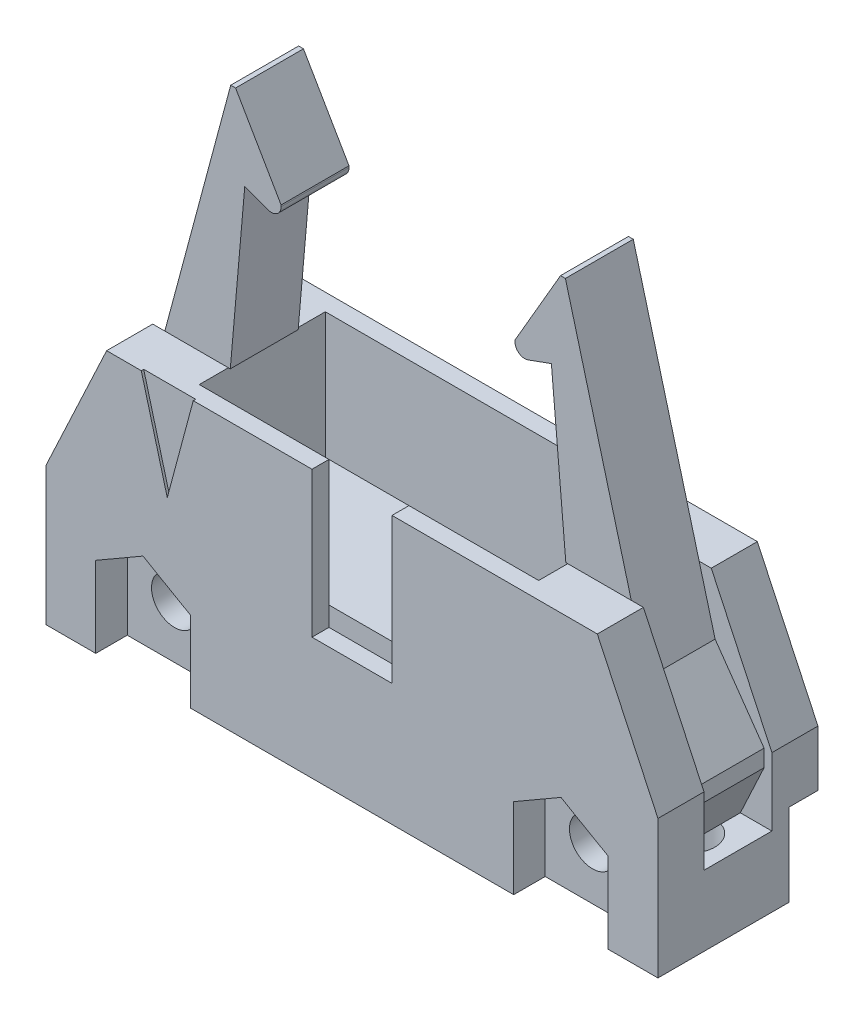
ISO-10303-21;
HEADER;
FILE_DESCRIPTION(('STEP AP214'),'2;1');
FILE_NAME('part.step','',(''),(''),'','','');
FILE_SCHEMA(('AUTOMOTIVE_DESIGN { 1 0 10303 214 1 1 1 1 }'));
ENDSEC;
DATA;
#1=APPLICATION_CONTEXT('core data for automotive mechanical design processes');
#2=APPLICATION_PROTOCOL_DEFINITION('international standard','automotive_design',2000,#1);
#3=PRODUCT_CONTEXT('',#1,'mechanical');
#4=PRODUCT('Part','Part','',(#3));
#5=PRODUCT_RELATED_PRODUCT_CATEGORY('part','',(#4));
#6=PRODUCT_DEFINITION_FORMATION('','',#4);
#7=PRODUCT_DEFINITION_CONTEXT('part definition',#1,'design');
#8=PRODUCT_DEFINITION('design','',#6,#7);
#9=PRODUCT_DEFINITION_SHAPE('','',#8);
#10=(LENGTH_UNIT() NAMED_UNIT(*) SI_UNIT(.MILLI.,.METRE.));
#11=(NAMED_UNIT(*) PLANE_ANGLE_UNIT() SI_UNIT($,.RADIAN.));
#12=(NAMED_UNIT(*) SI_UNIT($,.STERADIAN.) SOLID_ANGLE_UNIT());
#13=UNCERTAINTY_MEASURE_WITH_UNIT(LENGTH_MEASURE(1.E-05),#10,'distance_accuracy_value','');
#14=(GEOMETRIC_REPRESENTATION_CONTEXT(3) GLOBAL_UNCERTAINTY_ASSIGNED_CONTEXT((#13)) GLOBAL_UNIT_ASSIGNED_CONTEXT((#10,
#11,#12)) REPRESENTATION_CONTEXT('',''));
#15=CARTESIAN_POINT('',(0.,0.,0.));
#16=DIRECTION('',(0.,0.,1.));
#17=DIRECTION('',(1.,0.,0.));
#18=AXIS2_PLACEMENT_3D('',#15,#16,#17);
#19=CARTESIAN_POINT('',(0.,0.,-8.382));
#20=DIRECTION('',(0.,-1.,0.));
#21=DIRECTION('',(0.,0.,-1.));
#22=AXIS2_PLACEMENT_3D('',#19,#20,#21);
#23=PLANE('',#22);
#24=CARTESIAN_POINT('',(2.032,0.,-3.7338));
#25=DIRECTION('',(0.,-1.,0.));
#26=DIRECTION('',(0.,0.,-1.));
#27=AXIS2_PLACEMENT_3D('',#24,#25,#26);
#28=CIRCLE('',#27,1.27);
#29=CARTESIAN_POINT('',(2.032,0.,-5.0038));
#30=VERTEX_POINT('',#29);
#31=EDGE_CURVE('E499',#30,#30,#28,.T.);
#32=ORIENTED_EDGE('',*,*,#31,.F.);
#33=EDGE_LOOP('',(#32));
#34=FACE_BOUND('',#33,.T.);
#35=CARTESIAN_POINT('',(30.0228,0.,-3.73379999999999));
#36=DIRECTION('',(0.,-1.,0.));
#37=DIRECTION('',(0.,0.,1.));
#38=AXIS2_PLACEMENT_3D('',#35,#36,#37);
#39=CIRCLE('',#38,1.27000000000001);
#40=CARTESIAN_POINT('',(30.0228,0.,-2.46379999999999));
#41=VERTEX_POINT('',#40);
#42=EDGE_CURVE('E454',#41,#41,#39,.T.);
#43=ORIENTED_EDGE('',*,*,#42,.F.);
#44=EDGE_LOOP('',(#43));
#45=FACE_BOUND('',#44,.T.);
#46=DIRECTION('',(0.,0.,1.));
#47=VECTOR('',#46,1.);
#48=CARTESIAN_POINT('',(0.,0.,-8.382));
#49=LINE('',#48,#47);
#50=CARTESIAN_POINT('',(0.,0.,-6.858));
#51=VERTEX_POINT('',#50);
#52=CARTESIAN_POINT('',(0.,0.,0.));
#53=VERTEX_POINT('',#52);
#54=EDGE_CURVE('E43',#51,#53,#49,.T.);
#55=ORIENTED_EDGE('',*,*,#54,.F.);
#56=DIRECTION('',(-1.,0.,0.));
#57=VECTOR('',#56,1.);
#58=CARTESIAN_POINT('',(33.2994,0.,-6.858));
#59=LINE('',#58,#57);
#60=CARTESIAN_POINT('',(32.0548,0.,-6.858));
#61=VERTEX_POINT('',#60);
#62=EDGE_CURVE('E444',#61,#51,#59,.T.);
#63=ORIENTED_EDGE('',*,*,#62,.F.);
#64=DIRECTION('',(0.,0.,1.));
#65=VECTOR('',#64,1.);
#66=CARTESIAN_POINT('',(32.0548,0.,-8.382));
#67=LINE('',#66,#65);
#68=CARTESIAN_POINT('',(32.0548,0.,0.));
#69=VERTEX_POINT('',#68);
#70=EDGE_CURVE('E11',#61,#69,#67,.T.);
#71=ORIENTED_EDGE('',*,*,#70,.T.);
#72=DIRECTION('',(1.,0.,0.));
#73=VECTOR('',#72,1.);
#74=CARTESIAN_POINT('',(0.,0.,0.));
#75=LINE('',#74,#73);
#76=CARTESIAN_POINT('',(29.4513,0.,0.));
#77=VERTEX_POINT('',#76);
#78=EDGE_CURVE('E471',#77,#69,#75,.T.);
#79=ORIENTED_EDGE('',*,*,#78,.F.);
#80=DIRECTION('',(0.,0.,1.));
#81=VECTOR('',#80,1.);
#82=CARTESIAN_POINT('',(29.4513,0.,-1.651));
#83=LINE('',#82,#81);
#84=CARTESIAN_POINT('',(29.4513,0.,-1.651));
#85=VERTEX_POINT('',#84);
#86=EDGE_CURVE('E528',#85,#77,#83,.T.);
#87=ORIENTED_EDGE('',*,*,#86,.F.);
#88=DIRECTION('',(1.,0.,0.));
#89=VECTOR('',#88,1.);
#90=CARTESIAN_POINT('',(29.4513,0.,-1.651));
#91=LINE('',#90,#89);
#92=CARTESIAN_POINT('',(24.4983,0.,-1.651));
#93=VERTEX_POINT('',#92);
#94=EDGE_CURVE('E516',#93,#85,#91,.T.);
#95=ORIENTED_EDGE('',*,*,#94,.F.);
#96=DIRECTION('',(0.,0.,1.));
#97=VECTOR('',#96,1.);
#98=CARTESIAN_POINT('',(24.4983,0.,-1.651));
#99=LINE('',#98,#97);
#100=CARTESIAN_POINT('',(24.4983,0.,0.));
#101=VERTEX_POINT('',#100);
#102=EDGE_CURVE('E531',#93,#101,#99,.T.);
#103=ORIENTED_EDGE('',*,*,#102,.T.);
#104=CARTESIAN_POINT('',(7.5565,0.,0.));
#105=VERTEX_POINT('',#104);
#106=EDGE_CURVE('E477',#105,#101,#75,.T.);
#107=ORIENTED_EDGE('',*,*,#106,.F.);
#108=DIRECTION('',(0.,0.,1.));
#109=VECTOR('',#108,1.);
#110=CARTESIAN_POINT('',(7.5565,0.,-1.651));
#111=LINE('',#110,#109);
#112=CARTESIAN_POINT('',(7.5565,0.,-1.651));
#113=VERTEX_POINT('',#112);
#114=EDGE_CURVE('E556',#113,#105,#111,.T.);
#115=ORIENTED_EDGE('',*,*,#114,.F.);
#116=DIRECTION('',(1.,0.,0.));
#117=VECTOR('',#116,1.);
#118=CARTESIAN_POINT('',(2.6035,0.,-1.651));
#119=LINE('',#118,#117);
#120=CARTESIAN_POINT('',(2.6035,0.,-1.651));
#121=VERTEX_POINT('',#120);
#122=EDGE_CURVE('E540',#121,#113,#119,.T.);
#123=ORIENTED_EDGE('',*,*,#122,.F.);
#124=DIRECTION('',(0.,0.,1.));
#125=VECTOR('',#124,1.);
#126=CARTESIAN_POINT('',(2.6035,0.,-1.651));
#127=LINE('',#126,#125);
#128=CARTESIAN_POINT('',(2.6035,0.,0.));
#129=VERTEX_POINT('',#128);
#130=EDGE_CURVE('E566',#121,#129,#127,.T.);
#131=ORIENTED_EDGE('',*,*,#130,.T.);
#132=EDGE_CURVE('E473',#53,#129,#75,.T.);
#133=ORIENTED_EDGE('',*,*,#132,.F.);
#134=EDGE_LOOP('',(#55,#63,#71,#79,#87,#95,#103,#107,#115,#123,#131,#133));
#135=FACE_BOUND('',#134,.T.);
#136=ADVANCED_FACE('F34',(#34,#45,#135),#23,.T.);
#137=CARTESIAN_POINT('',(5.08,2.794,-8.382));
#138=DIRECTION('',(0.,0.,1.));
#139=DIRECTION('',(1.,0.,0.));
#140=AXIS2_PLACEMENT_3D('',#137,#138,#139);
#141=CYLINDRICAL_SURFACE('',#140,1.2065);
#142=CARTESIAN_POINT('',(5.08,2.794,-1.651));
#143=DIRECTION('',(0.,0.,1.));
#144=DIRECTION('',(1.,0.,0.));
#145=AXIS2_PLACEMENT_3D('',#142,#143,#144);
#146=CIRCLE('',#145,1.2065);
#147=CARTESIAN_POINT('',(6.2865,2.794,-1.651));
#148=VERTEX_POINT('',#147);
#149=EDGE_CURVE('E485',#148,#148,#146,.T.);
#150=ORIENTED_EDGE('',*,*,#149,.T.);
#151=EDGE_LOOP('',(#150));
#152=FACE_BOUND('',#151,.T.);
#153=CARTESIAN_POINT('',(5.08,2.794,-6.858));
#154=DIRECTION('',(0.,0.,-1.));
#155=DIRECTION('',(-1.,0.,0.));
#156=AXIS2_PLACEMENT_3D('',#153,#154,#155);
#157=CIRCLE('',#156,1.2065);
#158=CARTESIAN_POINT('',(3.8735,2.794,-6.858));
#159=VERTEX_POINT('',#158);
#160=EDGE_CURVE('E1286',#159,#159,#157,.F.);
#161=ORIENTED_EDGE('',*,*,#160,.F.);
#162=EDGE_LOOP('',(#161));
#163=FACE_BOUND('',#162,.T.);
#164=ADVANCED_FACE('F1037',(#152,#163),#141,.F.);
#165=CARTESIAN_POINT('',(26.9748,2.794,-8.382));
#166=DIRECTION('',(0.,0.,1.));
#167=DIRECTION('',(1.,0.,0.));
#168=AXIS2_PLACEMENT_3D('',#165,#166,#167);
#169=CYLINDRICAL_SURFACE('',#168,1.2065);
#170=CARTESIAN_POINT('',(26.9748,2.794,-1.651));
#171=DIRECTION('',(0.,0.,-1.));
#172=DIRECTION('',(-1.,0.,0.));
#173=AXIS2_PLACEMENT_3D('',#170,#171,#172);
#174=CIRCLE('',#173,1.2065);
#175=CARTESIAN_POINT('',(25.7683,2.794,-1.651));
#176=VERTEX_POINT('',#175);
#177=EDGE_CURVE('E488',#176,#176,#174,.T.);
#178=ORIENTED_EDGE('',*,*,#177,.F.);
#179=EDGE_LOOP('',(#178));
#180=FACE_BOUND('',#179,.T.);
#181=CARTESIAN_POINT('',(26.9748,2.794,-6.858));
#182=DIRECTION('',(0.,0.,-1.));
#183=DIRECTION('',(-1.,0.,0.));
#184=AXIS2_PLACEMENT_3D('',#181,#182,#183);
#185=CIRCLE('',#184,1.2065);
#186=CARTESIAN_POINT('',(25.7683,2.794,-6.858));
#187=VERTEX_POINT('',#186);
#188=EDGE_CURVE('E38',#187,#187,#185,.F.);
#189=ORIENTED_EDGE('',*,*,#188,.F.);
#190=EDGE_LOOP('',(#189));
#191=FACE_BOUND('',#190,.T.);
#192=ADVANCED_FACE('F1042',(#180,#191),#169,.F.);
#193=CARTESIAN_POINT('',(0.,14.0208,-8.382));
#194=DIRECTION('',(0.,1.,0.));
#195=DIRECTION('',(0.,0.,1.));
#196=AXIS2_PLACEMENT_3D('',#193,#194,#195);
#197=PLANE('',#196);
#198=DIRECTION('',(1.,0.,0.));
#199=VECTOR('',#198,1.);
#200=CARTESIAN_POINT('',(24.8158,14.0208,-5.969));
#201=LINE('',#200,#199);
#202=CARTESIAN_POINT('',(24.9174,14.0208,-5.969));
#203=VERTEX_POINT('',#202);
#204=CARTESIAN_POINT('',(28.2448,14.0208,-5.969));
#205=VERTEX_POINT('',#204);
#206=EDGE_CURVE('E724',#203,#205,#201,.T.);
#207=ORIENTED_EDGE('',*,*,#206,.T.);
#208=DIRECTION('',(-1.,0.,0.));
#209=VECTOR('',#208,1.);
#210=CARTESIAN_POINT('',(28.2448,14.0208,-5.969));
#211=LINE('',#210,#209);
#212=CARTESIAN_POINT('',(28.8798,14.0208,-5.969));
#213=VERTEX_POINT('',#212);
#214=EDGE_CURVE('E618',#213,#205,#211,.T.);
#215=ORIENTED_EDGE('',*,*,#214,.F.);
#216=DIRECTION('',(0.,0.,1.));
#217=VECTOR('',#216,1.);
#218=CARTESIAN_POINT('',(28.8798,14.0208,-8.382));
#219=LINE('',#218,#217);
#220=CARTESIAN_POINT('',(28.8798,14.0208,-8.382));
#221=VERTEX_POINT('',#220);
#222=EDGE_CURVE('E919',#221,#213,#219,.T.);
#223=ORIENTED_EDGE('',*,*,#222,.F.);
#224=DIRECTION('',(-1.,0.,0.));
#225=VECTOR('',#224,1.);
#226=CARTESIAN_POINT('',(0.,14.0208,-8.382));
#227=LINE('',#226,#225);
#228=CARTESIAN_POINT('',(3.175,14.0208,-8.382));
#229=VERTEX_POINT('',#228);
#230=EDGE_CURVE('E460',#221,#229,#227,.T.);
#231=ORIENTED_EDGE('',*,*,#230,.T.);
#232=DIRECTION('',(0.,0.,1.));
#233=VECTOR('',#232,1.);
#234=CARTESIAN_POINT('',(3.175,14.0208,-8.382));
#235=LINE('',#234,#233);
#236=CARTESIAN_POINT('',(3.175,14.0208,-5.969));
#237=VERTEX_POINT('',#236);
#238=EDGE_CURVE('E472',#229,#237,#235,.T.);
#239=ORIENTED_EDGE('',*,*,#238,.T.);
#240=DIRECTION('',(-1.,0.,0.));
#241=VECTOR('',#240,1.);
#242=CARTESIAN_POINT('',(3.81,14.0208,-5.969));
#243=LINE('',#242,#241);
#244=CARTESIAN_POINT('',(3.81,14.0208,-5.969));
#245=VERTEX_POINT('',#244);
#246=EDGE_CURVE('E663',#245,#237,#243,.T.);
#247=ORIENTED_EDGE('',*,*,#246,.F.);
#248=DIRECTION('',(1.,0.,0.));
#249=VECTOR('',#248,1.);
#250=CARTESIAN_POINT('',(7.239,14.0208,-5.969));
#251=LINE('',#250,#249);
#252=CARTESIAN_POINT('',(7.1374,14.0208,-5.969));
#253=VERTEX_POINT('',#252);
#254=EDGE_CURVE('E782',#245,#253,#251,.T.);
#255=ORIENTED_EDGE('',*,*,#254,.T.);
#256=DIRECTION('',(0.,0.,1.));
#257=VECTOR('',#256,1.);
#258=CARTESIAN_POINT('',(7.1374,14.0208,-7.493));
#259=LINE('',#258,#257);
#260=CARTESIAN_POINT('',(7.1374,14.0208,-7.493));
#261=VERTEX_POINT('',#260);
#262=EDGE_CURVE('E896',#261,#253,#259,.T.);
#263=ORIENTED_EDGE('',*,*,#262,.F.);
#264=DIRECTION('',(-1.,0.,0.));
#265=VECTOR('',#264,1.);
#266=CARTESIAN_POINT('',(7.1374,14.0208,-7.493));
#267=LINE('',#266,#265);
#268=CARTESIAN_POINT('',(24.9174,14.0208,-7.493));
#269=VERTEX_POINT('',#268);
#270=EDGE_CURVE('E891',#269,#261,#267,.T.);
#271=ORIENTED_EDGE('',*,*,#270,.F.);
#272=DIRECTION('',(0.,0.,-1.));
#273=VECTOR('',#272,1.);
#274=CARTESIAN_POINT('',(24.9174,14.0208,-7.493));
#275=LINE('',#274,#273);
#276=EDGE_CURVE('E887',#203,#269,#275,.T.);
#277=ORIENTED_EDGE('',*,*,#276,.F.);
#278=EDGE_LOOP('',(#207,#215,#223,#231,#239,#247,#255,#263,#271,#277));
#279=FACE_BOUND('',#278,.T.);
#280=ADVANCED_FACE('F1051',(#279),#197,.T.);
#281=CARTESIAN_POINT('',(32.0548,0.,-8.382));
#282=DIRECTION('',(1.,0.,0.));
#283=DIRECTION('',(0.,0.,-1.));
#284=AXIS2_PLACEMENT_3D('',#281,#282,#283);
#285=PLANE('',#284);
#286=DIRECTION('',(0.,0.,1.));
#287=VECTOR('',#286,1.);
#288=CARTESIAN_POINT('',(32.0548,4.318,-8.382));
#289=LINE('',#288,#287);
#290=CARTESIAN_POINT('',(32.0548,4.318,-8.382));
#291=VERTEX_POINT('',#290);
#292=CARTESIAN_POINT('',(32.0548,4.318,-6.858));
#293=VERTEX_POINT('',#292);
#294=EDGE_CURVE('E438',#291,#293,#289,.T.);
#295=ORIENTED_EDGE('',*,*,#294,.F.);
#296=DIRECTION('',(0.,1.,0.));
#297=VECTOR('',#296,1.);
#298=CARTESIAN_POINT('',(32.0548,0.,-8.382));
#299=LINE('',#298,#297);
#300=CARTESIAN_POINT('',(32.0548,7.23900000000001,-8.382));
#301=VERTEX_POINT('',#300);
#302=EDGE_CURVE('E450',#291,#301,#299,.T.);
#303=ORIENTED_EDGE('',*,*,#302,.T.);
#304=DIRECTION('',(0.,0.,1.));
#305=VECTOR('',#304,1.);
#306=CARTESIAN_POINT('',(32.0548,7.23900000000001,-8.382));
#307=LINE('',#306,#305);
#308=CARTESIAN_POINT('',(32.0548,7.239,-5.969));
#309=VERTEX_POINT('',#308);
#310=EDGE_CURVE('E915',#301,#309,#307,.T.);
#311=ORIENTED_EDGE('',*,*,#310,.T.);
#312=DIRECTION('',(0.,1.,0.));
#313=VECTOR('',#312,1.);
#314=CARTESIAN_POINT('',(32.0548,7.239,-5.969));
#315=LINE('',#314,#313);
#316=CARTESIAN_POINT('',(32.0548,3.683,-5.969));
#317=VERTEX_POINT('',#316);
#318=EDGE_CURVE('E614',#317,#309,#315,.T.);
#319=ORIENTED_EDGE('',*,*,#318,.F.);
#320=DIRECTION('',(0.,0.,1.));
#321=VECTOR('',#320,1.);
#322=CARTESIAN_POINT('',(32.0548,3.683,-5.969));
#323=LINE('',#322,#321);
#324=CARTESIAN_POINT('',(32.0548,3.683,-2.413));
#325=VERTEX_POINT('',#324);
#326=EDGE_CURVE('E643',#317,#325,#323,.T.);
#327=ORIENTED_EDGE('',*,*,#326,.T.);
#328=DIRECTION('',(0.,1.,0.));
#329=VECTOR('',#328,1.);
#330=CARTESIAN_POINT('',(32.0548,7.239,-2.413));
#331=LINE('',#330,#329);
#332=CARTESIAN_POINT('',(32.0548,7.239,-2.413));
#333=VERTEX_POINT('',#332);
#334=EDGE_CURVE('E635',#325,#333,#331,.T.);
#335=ORIENTED_EDGE('',*,*,#334,.T.);
#336=CARTESIAN_POINT('',(32.0548,7.23900000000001,0.));
#337=VERTEX_POINT('',#336);
#338=EDGE_CURVE('E918',#333,#337,#307,.T.);
#339=ORIENTED_EDGE('',*,*,#338,.T.);
#340=DIRECTION('',(0.,1.,0.));
#341=VECTOR('',#340,1.);
#342=CARTESIAN_POINT('',(32.0548,0.,0.));
#343=LINE('',#342,#341);
#344=EDGE_CURVE('E476',#69,#337,#343,.T.);
#345=ORIENTED_EDGE('',*,*,#344,.F.);
#346=ORIENTED_EDGE('',*,*,#70,.F.);
#347=DIRECTION('',(0.,1.,0.));
#348=VECTOR('',#347,1.);
#349=CARTESIAN_POINT('',(32.0548,0.,-6.858));
#350=LINE('',#349,#348);
#351=EDGE_CURVE('E453',#61,#293,#350,.T.);
#352=ORIENTED_EDGE('',*,*,#351,.T.);
#353=EDGE_LOOP('',(#295,#303,#311,#319,#327,#335,#339,#345,#346,#352));
#354=FACE_BOUND('',#353,.T.);
#355=ADVANCED_FACE('F448',(#354),#285,.T.);
#356=CARTESIAN_POINT('',(28.8798,14.0208,-8.382));
#357=DIRECTION('',(-0.905662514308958,-0.42399930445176,0.));
#358=DIRECTION('',(0.42399930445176,-0.905662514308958,0.));
#359=AXIS2_PLACEMENT_3D('',#356,#357,#358);
#360=PLANE('',#359);
#361=DIRECTION('',(-0.423999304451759,0.905662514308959,0.));
#362=VECTOR('',#361,1.);
#363=CARTESIAN_POINT('',(32.0548,7.239,-5.969));
#364=LINE('',#363,#362);
#365=EDGE_CURVE('E616',#309,#213,#364,.T.);
#366=ORIENTED_EDGE('',*,*,#365,.F.);
#367=ORIENTED_EDGE('',*,*,#310,.F.);
#368=DIRECTION('',(0.42399930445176,-0.905662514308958,0.));
#369=VECTOR('',#368,1.);
#370=CARTESIAN_POINT('',(28.8798,14.0208,-8.382));
#371=LINE('',#370,#369);
#372=EDGE_CURVE('E459',#221,#301,#371,.T.);
#373=ORIENTED_EDGE('',*,*,#372,.F.);
#374=ORIENTED_EDGE('',*,*,#222,.T.);
#375=EDGE_LOOP('',(#366,#367,#373,#374));
#376=FACE_BOUND('',#375,.T.);
#377=ADVANCED_FACE('F1050',(#376),#360,.F.);
#378=DIRECTION('',(0.,0.,1.));
#379=VECTOR('',#378,1.);
#380=CARTESIAN_POINT('',(7.71118189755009,14.0208,-0.127));
#381=LINE('',#380,#379);
#382=CARTESIAN_POINT('',(7.71118189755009,14.0208,-0.127));
#383=VERTEX_POINT('',#382);
#384=CARTESIAN_POINT('',(7.71118189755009,14.0208,0.));
#385=VERTEX_POINT('',#384);
#386=EDGE_CURVE('E591',#383,#385,#381,.T.);
#387=ORIENTED_EDGE('',*,*,#386,.T.);
#388=DIRECTION('',(-1.,0.,0.));
#389=VECTOR('',#388,1.);
#390=CARTESIAN_POINT('',(0.,14.0208,0.));
#391=LINE('',#390,#389);
#392=CARTESIAN_POINT('',(13.9319,14.0208,0.));
#393=VERTEX_POINT('',#392);
#394=EDGE_CURVE('E482',#393,#385,#391,.T.);
#395=ORIENTED_EDGE('',*,*,#394,.F.);
#396=DIRECTION('',(0.,0.,1.));
#397=VECTOR('',#396,1.);
#398=CARTESIAN_POINT('',(13.9319,14.0208,-0.889));
#399=LINE('',#398,#397);
#400=CARTESIAN_POINT('',(13.9319,14.0208,-0.889));
#401=VERTEX_POINT('',#400);
#402=EDGE_CURVE('E852',#401,#393,#399,.T.);
#403=ORIENTED_EDGE('',*,*,#402,.F.);
#404=DIRECTION('',(1.,0.,0.));
#405=VECTOR('',#404,1.);
#406=CARTESIAN_POINT('',(7.1374,14.0208,-0.889000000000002));
#407=LINE('',#406,#405);
#408=CARTESIAN_POINT('',(7.1374,14.0208,-0.889000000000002));
#409=VERTEX_POINT('',#408);
#410=EDGE_CURVE('E884',#409,#401,#407,.T.);
#411=ORIENTED_EDGE('',*,*,#410,.F.);
#412=CARTESIAN_POINT('',(7.1374,14.0208,-2.413));
#413=VERTEX_POINT('',#412);
#414=EDGE_CURVE('E895',#413,#409,#259,.T.);
#415=ORIENTED_EDGE('',*,*,#414,.F.);
#416=DIRECTION('',(1.,0.,0.));
#417=VECTOR('',#416,1.);
#418=CARTESIAN_POINT('',(7.239,14.0208,-2.413));
#419=LINE('',#418,#417);
#420=CARTESIAN_POINT('',(3.81,14.0208,-2.413));
#421=VERTEX_POINT('',#420);
#422=EDGE_CURVE('E807',#421,#413,#419,.T.);
#423=ORIENTED_EDGE('',*,*,#422,.F.);
#424=DIRECTION('',(-1.,0.,0.));
#425=VECTOR('',#424,1.);
#426=CARTESIAN_POINT('',(3.81,14.0208,-2.413));
#427=LINE('',#426,#425);
#428=CARTESIAN_POINT('',(3.175,14.0208,-2.413));
#429=VERTEX_POINT('',#428);
#430=EDGE_CURVE('E684',#421,#429,#427,.T.);
#431=ORIENTED_EDGE('',*,*,#430,.T.);
#432=CARTESIAN_POINT('',(3.175,14.0208,0.));
#433=VERTEX_POINT('',#432);
#434=EDGE_CURVE('E929',#429,#433,#235,.T.);
#435=ORIENTED_EDGE('',*,*,#434,.T.);
#436=CARTESIAN_POINT('',(4.98881810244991,14.0208,0.));
#437=VERTEX_POINT('',#436);
#438=EDGE_CURVE('E480',#437,#433,#391,.T.);
#439=ORIENTED_EDGE('',*,*,#438,.F.);
#440=DIRECTION('',(0.,0.,1.));
#441=VECTOR('',#440,1.);
#442=CARTESIAN_POINT('',(4.98881810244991,14.0208,-0.127));
#443=LINE('',#442,#441);
#444=CARTESIAN_POINT('',(4.98881810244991,14.0208,-0.127));
#445=VERTEX_POINT('',#444);
#446=EDGE_CURVE('E587',#445,#437,#443,.T.);
#447=ORIENTED_EDGE('',*,*,#446,.F.);
#448=DIRECTION('',(-1.,0.,0.));
#449=VECTOR('',#448,1.);
#450=CARTESIAN_POINT('',(7.71118189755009,14.0208,-0.127));
#451=LINE('',#450,#449);
#452=EDGE_CURVE('E577',#383,#445,#451,.T.);
#453=ORIENTED_EDGE('',*,*,#452,.F.);
#454=EDGE_LOOP('',(#387,#395,#403,#411,#415,#423,#431,#435,#439,#447,#453));
#455=FACE_BOUND('',#454,.T.);
#456=ADVANCED_FACE('F1017',(#455),#197,.T.);
#457=CARTESIAN_POINT('',(3.175,14.0208,-8.382));
#458=DIRECTION('',(0.905662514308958,-0.423999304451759,0.));
#459=DIRECTION('',(0.423999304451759,0.905662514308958,0.));
#460=AXIS2_PLACEMENT_3D('',#457,#458,#459);
#461=PLANE('',#460);
#462=DIRECTION('',(-0.423999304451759,-0.905662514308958,0.));
#463=VECTOR('',#462,1.);
#464=CARTESIAN_POINT('',(0.,7.239,-2.413));
#465=LINE('',#464,#463);
#466=CARTESIAN_POINT('',(0.,7.239,-2.413));
#467=VERTEX_POINT('',#466);
#468=EDGE_CURVE('E687',#429,#467,#465,.T.);
#469=ORIENTED_EDGE('',*,*,#468,.T.);
#470=DIRECTION('',(0.,0.,1.));
#471=VECTOR('',#470,1.);
#472=CARTESIAN_POINT('',(0.,7.239,-8.382));
#473=LINE('',#472,#471);
#474=CARTESIAN_POINT('',(0.,7.239,0.));
#475=VERTEX_POINT('',#474);
#476=EDGE_CURVE('E925',#467,#475,#473,.T.);
#477=ORIENTED_EDGE('',*,*,#476,.T.);
#478=DIRECTION('',(0.423999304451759,0.905662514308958,0.));
#479=VECTOR('',#478,1.);
#480=CARTESIAN_POINT('',(3.175,14.0208,0.));
#481=LINE('',#480,#479);
#482=EDGE_CURVE('E917',#475,#433,#481,.T.);
#483=ORIENTED_EDGE('',*,*,#482,.T.);
#484=ORIENTED_EDGE('',*,*,#434,.F.);
#485=EDGE_LOOP('',(#469,#477,#483,#484));
#486=FACE_BOUND('',#485,.T.);
#487=ADVANCED_FACE('F939',(#486),#461,.F.);
#488=CARTESIAN_POINT('',(7.1374,7.4168,-0.889000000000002));
#489=DIRECTION('',(0.,0.,1.));
#490=DIRECTION('',(1.,0.,0.));
#491=AXIS2_PLACEMENT_3D('',#488,#489,#490);
#492=PLANE('',#491);
#493=DIRECTION('',(1.,0.,0.));
#494=VECTOR('',#493,1.);
#495=CARTESIAN_POINT('',(7.1374,7.4168,-0.889000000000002));
#496=LINE('',#495,#494);
#497=CARTESIAN_POINT('',(18.1229,7.4168,-0.889000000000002));
#498=VERTEX_POINT('',#497);
#499=CARTESIAN_POINT('',(24.9174,7.4168,-0.889000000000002));
#500=VERTEX_POINT('',#499);
#501=EDGE_CURVE('E874',#498,#500,#496,.T.);
#502=ORIENTED_EDGE('',*,*,#501,.F.);
#503=DIRECTION('',(0.,1.,0.));
#504=VECTOR('',#503,1.);
#505=CARTESIAN_POINT('',(18.1229,14.0208,-0.889));
#506=LINE('',#505,#504);
#507=CARTESIAN_POINT('',(18.1229,14.0208,-0.889));
#508=VERTEX_POINT('',#507);
#509=EDGE_CURVE('E849',#498,#508,#506,.T.);
#510=ORIENTED_EDGE('',*,*,#509,.T.);
#511=CARTESIAN_POINT('',(24.9174,14.0208,-0.889000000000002));
#512=VERTEX_POINT('',#511);
#513=EDGE_CURVE('E863',#508,#512,#407,.T.);
#514=ORIENTED_EDGE('',*,*,#513,.T.);
#515=DIRECTION('',(0.,1.,0.));
#516=VECTOR('',#515,1.);
#517=CARTESIAN_POINT('',(24.9174,7.4168,-0.889000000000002));
#518=LINE('',#517,#516);
#519=EDGE_CURVE('E883',#500,#512,#518,.T.);
#520=ORIENTED_EDGE('',*,*,#519,.F.);
#521=EDGE_LOOP('',(#502,#510,#514,#520));
#522=FACE_BOUND('',#521,.T.);
#523=ADVANCED_FACE('F997',(#522),#492,.F.);
#524=CARTESIAN_POINT('',(0.,0.,-8.382));
#525=DIRECTION('',(-1.,0.,0.));
#526=DIRECTION('',(0.,0.,1.));
#527=AXIS2_PLACEMENT_3D('',#524,#525,#526);
#528=PLANE('',#527);
#529=DIRECTION('',(0.,0.,-1.));
#530=VECTOR('',#529,1.);
#531=CARTESIAN_POINT('',(0.,4.318,-8.382));
#532=LINE('',#531,#530);
#533=CARTESIAN_POINT('',(0.,4.318,-6.858));
#534=VERTEX_POINT('',#533);
#535=CARTESIAN_POINT('',(0.,4.318,-8.382));
#536=VERTEX_POINT('',#535);
#537=EDGE_CURVE('E51',#534,#536,#532,.T.);
#538=ORIENTED_EDGE('',*,*,#537,.F.);
#539=DIRECTION('',(0.,-1.,0.));
#540=VECTOR('',#539,1.);
#541=CARTESIAN_POINT('',(0.,0.,-6.858));
#542=LINE('',#541,#540);
#543=EDGE_CURVE('E951',#534,#51,#542,.T.);
#544=ORIENTED_EDGE('',*,*,#543,.T.);
#545=ORIENTED_EDGE('',*,*,#54,.T.);
#546=DIRECTION('',(0.,-1.,0.));
#547=VECTOR('',#546,1.);
#548=CARTESIAN_POINT('',(0.,0.,0.));
#549=LINE('',#548,#547);
#550=EDGE_CURVE('E468',#475,#53,#549,.T.);
#551=ORIENTED_EDGE('',*,*,#550,.F.);
#552=ORIENTED_EDGE('',*,*,#476,.F.);
#553=DIRECTION('',(0.,-1.,0.));
#554=VECTOR('',#553,1.);
#555=CARTESIAN_POINT('',(0.,7.239,-2.413));
#556=LINE('',#555,#554);
#557=CARTESIAN_POINT('',(0.,3.683,-2.413));
#558=VERTEX_POINT('',#557);
#559=EDGE_CURVE('E690',#467,#558,#556,.T.);
#560=ORIENTED_EDGE('',*,*,#559,.T.);
#561=DIRECTION('',(0.,0.,1.));
#562=VECTOR('',#561,1.);
#563=CARTESIAN_POINT('',(0.,3.683,-5.969));
#564=LINE('',#563,#562);
#565=CARTESIAN_POINT('',(0.,3.683,-5.969));
#566=VERTEX_POINT('',#565);
#567=EDGE_CURVE('E711',#566,#558,#564,.T.);
#568=ORIENTED_EDGE('',*,*,#567,.F.);
#569=DIRECTION('',(0.,-1.,0.));
#570=VECTOR('',#569,1.);
#571=CARTESIAN_POINT('',(0.,7.239,-5.969));
#572=LINE('',#571,#570);
#573=CARTESIAN_POINT('',(0.,7.239,-5.969));
#574=VERTEX_POINT('',#573);
#575=EDGE_CURVE('E667',#574,#566,#572,.T.);
#576=ORIENTED_EDGE('',*,*,#575,.F.);
#577=CARTESIAN_POINT('',(0.,7.239,-8.382));
#578=VERTEX_POINT('',#577);
#579=EDGE_CURVE('E930',#578,#574,#473,.T.);
#580=ORIENTED_EDGE('',*,*,#579,.F.);
#581=DIRECTION('',(0.,-1.,0.));
#582=VECTOR('',#581,1.);
#583=CARTESIAN_POINT('',(0.,0.,-8.382));
#584=LINE('',#583,#582);
#585=EDGE_CURVE('E461',#578,#536,#584,.T.);
#586=ORIENTED_EDGE('',*,*,#585,.T.);
#587=EDGE_LOOP('',(#538,#544,#545,#551,#552,#560,#568,#576,#580,#586));
#588=FACE_BOUND('',#587,.T.);
#589=ADVANCED_FACE('F36',(#588),#528,.T.);
#590=DIRECTION('',(-1.,0.,0.));
#591=VECTOR('',#590,1.);
#592=CARTESIAN_POINT('',(28.2448,14.0208,-2.413));
#593=LINE('',#592,#591);
#594=CARTESIAN_POINT('',(28.8798,14.0208,-2.413));
#595=VERTEX_POINT('',#594);
#596=CARTESIAN_POINT('',(28.2448,14.0208,-2.413));
#597=VERTEX_POINT('',#596);
#598=EDGE_CURVE('E602',#595,#597,#593,.T.);
#599=ORIENTED_EDGE('',*,*,#598,.T.);
#600=DIRECTION('',(1.,0.,0.));
#601=VECTOR('',#600,1.);
#602=CARTESIAN_POINT('',(24.8158,14.0208,-2.413));
#603=LINE('',#602,#601);
#604=CARTESIAN_POINT('',(24.9174,14.0208,-2.413));
#605=VERTEX_POINT('',#604);
#606=EDGE_CURVE('E748',#605,#597,#603,.T.);
#607=ORIENTED_EDGE('',*,*,#606,.F.);
#608=EDGE_CURVE('E888',#512,#605,#275,.T.);
#609=ORIENTED_EDGE('',*,*,#608,.F.);
#610=ORIENTED_EDGE('',*,*,#513,.F.);
#611=DIRECTION('',(0.,0.,1.));
#612=VECTOR('',#611,1.);
#613=CARTESIAN_POINT('',(18.1229,14.0208,-0.889));
#614=LINE('',#613,#612);
#615=CARTESIAN_POINT('',(18.1229,14.0208,0.));
#616=VERTEX_POINT('',#615);
#617=EDGE_CURVE('E860',#508,#616,#614,.T.);
#618=ORIENTED_EDGE('',*,*,#617,.T.);
#619=CARTESIAN_POINT('',(28.8798,14.0208,0.));
#620=VERTEX_POINT('',#619);
#621=EDGE_CURVE('E464',#620,#616,#391,.T.);
#622=ORIENTED_EDGE('',*,*,#621,.F.);
#623=EDGE_CURVE('E912',#595,#620,#219,.T.);
#624=ORIENTED_EDGE('',*,*,#623,.F.);
#625=EDGE_LOOP('',(#599,#607,#609,#610,#618,#622,#624));
#626=FACE_BOUND('',#625,.T.);
#627=ADVANCED_FACE('F987',(#626),#197,.T.);
#628=CARTESIAN_POINT('',(0.,14.0208,-8.382));
#629=DIRECTION('',(0.,0.,-1.));
#630=DIRECTION('',(-1.,0.,0.));
#631=AXIS2_PLACEMENT_3D('',#628,#629,#630);
#632=PLANE('',#631);
#633=DIRECTION('',(1.,0.,0.));
#634=VECTOR('',#633,1.);
#635=CARTESIAN_POINT('',(-1.24460000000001,4.318,-8.382));
#636=LINE('',#635,#634);
#637=EDGE_CURVE('E435',#536,#291,#636,.T.);
#638=ORIENTED_EDGE('',*,*,#637,.F.);
#639=ORIENTED_EDGE('',*,*,#585,.F.);
#640=DIRECTION('',(0.423999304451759,0.905662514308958,0.));
#641=VECTOR('',#640,1.);
#642=CARTESIAN_POINT('',(3.175,14.0208,-8.382));
#643=LINE('',#642,#641);
#644=EDGE_CURVE('E922',#578,#229,#643,.T.);
#645=ORIENTED_EDGE('',*,*,#644,.T.);
#646=ORIENTED_EDGE('',*,*,#230,.F.);
#647=ORIENTED_EDGE('',*,*,#372,.T.);
#648=ORIENTED_EDGE('',*,*,#302,.F.);
#649=EDGE_LOOP('',(#638,#639,#645,#646,#647,#648));
#650=FACE_BOUND('',#649,.T.);
#651=ADVANCED_FACE('F457',(#650),#632,.T.);
#652=CARTESIAN_POINT('',(0.,14.0208,0.));
#653=DIRECTION('',(0.,0.,-1.));
#654=DIRECTION('',(-1.,0.,0.));
#655=AXIS2_PLACEMENT_3D('',#652,#653,#654);
#656=PLANE('',#655);
#657=DIRECTION('',(-0.866025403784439,0.5,0.));
#658=VECTOR('',#657,1.);
#659=CARTESIAN_POINT('',(26.9748,5.65361588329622,0.));
#660=LINE('',#659,#658);
#661=CARTESIAN_POINT('',(29.4513,4.22380794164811,0.));
#662=VERTEX_POINT('',#661);
#663=CARTESIAN_POINT('',(26.9748,5.65361588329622,0.));
#664=VERTEX_POINT('',#663);
#665=EDGE_CURVE('E521',#662,#664,#660,.T.);
#666=ORIENTED_EDGE('',*,*,#665,.F.);
#667=DIRECTION('',(0.,1.,0.));
#668=VECTOR('',#667,1.);
#669=CARTESIAN_POINT('',(29.4513,4.22380794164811,0.));
#670=LINE('',#669,#668);
#671=EDGE_CURVE('E487',#77,#662,#670,.T.);
#672=ORIENTED_EDGE('',*,*,#671,.F.);
#673=ORIENTED_EDGE('',*,*,#78,.T.);
#674=ORIENTED_EDGE('',*,*,#344,.T.);
#675=DIRECTION('',(0.42399930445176,-0.905662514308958,0.));
#676=VECTOR('',#675,1.);
#677=CARTESIAN_POINT('',(28.8798,14.0208,0.));
#678=LINE('',#677,#676);
#679=EDGE_CURVE('E903',#620,#337,#678,.T.);
#680=ORIENTED_EDGE('',*,*,#679,.F.);
#681=ORIENTED_EDGE('',*,*,#621,.T.);
#682=DIRECTION('',(0.,1.,0.));
#683=VECTOR('',#682,1.);
#684=CARTESIAN_POINT('',(18.1229,14.0208,0.));
#685=LINE('',#684,#683);
#686=CARTESIAN_POINT('',(18.1229,6.4008,0.));
#687=VERTEX_POINT('',#686);
#688=EDGE_CURVE('E858',#687,#616,#685,.T.);
#689=ORIENTED_EDGE('',*,*,#688,.F.);
#690=DIRECTION('',(1.,0.,0.));
#691=VECTOR('',#690,1.);
#692=CARTESIAN_POINT('',(13.9319,6.4008,0.));
#693=LINE('',#692,#691);
#694=CARTESIAN_POINT('',(13.9319,6.4008,0.));
#695=VERTEX_POINT('',#694);
#696=EDGE_CURVE('E855',#695,#687,#693,.T.);
#697=ORIENTED_EDGE('',*,*,#696,.F.);
#698=DIRECTION('',(0.,-1.,0.));
#699=VECTOR('',#698,1.);
#700=CARTESIAN_POINT('',(13.9319,14.0208,0.));
#701=LINE('',#700,#699);
#702=EDGE_CURVE('E829',#393,#695,#701,.T.);
#703=ORIENTED_EDGE('',*,*,#702,.F.);
#704=ORIENTED_EDGE('',*,*,#394,.T.);
#705=DIRECTION('',(0.258819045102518,0.965925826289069,0.));
#706=VECTOR('',#705,1.);
#707=CARTESIAN_POINT('',(6.35,8.94080000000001,0.));
#708=LINE('',#707,#706);
#709=CARTESIAN_POINT('',(6.35,8.94080000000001,0.));
#710=VERTEX_POINT('',#709);
#711=EDGE_CURVE('E581',#710,#385,#708,.T.);
#712=ORIENTED_EDGE('',*,*,#711,.F.);
#713=DIRECTION('',(0.258819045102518,-0.965925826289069,0.));
#714=VECTOR('',#713,1.);
#715=CARTESIAN_POINT('',(4.98881810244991,14.0208,0.));
#716=LINE('',#715,#714);
#717=EDGE_CURVE('E569',#437,#710,#716,.T.);
#718=ORIENTED_EDGE('',*,*,#717,.F.);
#719=ORIENTED_EDGE('',*,*,#438,.T.);
#720=ORIENTED_EDGE('',*,*,#482,.F.);
#721=ORIENTED_EDGE('',*,*,#550,.T.);
#722=ORIENTED_EDGE('',*,*,#132,.T.);
#723=DIRECTION('',(0.,-1.,0.));
#724=VECTOR('',#723,1.);
#725=CARTESIAN_POINT('',(2.6035,4.22380794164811,0.));
#726=LINE('',#725,#724);
#727=CARTESIAN_POINT('',(2.6035,4.22380794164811,0.));
#728=VERTEX_POINT('',#727);
#729=EDGE_CURVE('E544',#728,#129,#726,.T.);
#730=ORIENTED_EDGE('',*,*,#729,.F.);
#731=DIRECTION('',(-0.866025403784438,-0.5,0.));
#732=VECTOR('',#731,1.);
#733=CARTESIAN_POINT('',(5.08,5.65361588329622,0.));
#734=LINE('',#733,#732);
#735=CARTESIAN_POINT('',(5.08,5.65361588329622,0.));
#736=VERTEX_POINT('',#735);
#737=EDGE_CURVE('E562',#736,#728,#734,.T.);
#738=ORIENTED_EDGE('',*,*,#737,.F.);
#739=DIRECTION('',(-0.866025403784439,0.5,0.));
#740=VECTOR('',#739,1.);
#741=CARTESIAN_POINT('',(7.5565,4.2238079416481,0.));
#742=LINE('',#741,#740);
#743=CARTESIAN_POINT('',(7.5565,4.2238079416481,0.));
#744=VERTEX_POINT('',#743);
#745=EDGE_CURVE('E559',#744,#736,#742,.T.);
#746=ORIENTED_EDGE('',*,*,#745,.F.);
#747=DIRECTION('',(0.,1.,0.));
#748=VECTOR('',#747,1.);
#749=CARTESIAN_POINT('',(7.5565,0.,0.));
#750=LINE('',#749,#748);
#751=EDGE_CURVE('E530',#105,#744,#750,.T.);
#752=ORIENTED_EDGE('',*,*,#751,.F.);
#753=ORIENTED_EDGE('',*,*,#106,.T.);
#754=DIRECTION('',(0.,-1.,0.));
#755=VECTOR('',#754,1.);
#756=CARTESIAN_POINT('',(24.4983,0.,0.));
#757=LINE('',#756,#755);
#758=CARTESIAN_POINT('',(24.4983,4.22380794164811,0.));
#759=VERTEX_POINT('',#758);
#760=EDGE_CURVE('E507',#759,#101,#757,.T.);
#761=ORIENTED_EDGE('',*,*,#760,.F.);
#762=DIRECTION('',(-0.866025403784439,-0.5,0.));
#763=VECTOR('',#762,1.);
#764=CARTESIAN_POINT('',(24.4983,4.22380794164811,0.));
#765=LINE('',#764,#763);
#766=EDGE_CURVE('E524',#664,#759,#765,.T.);
#767=ORIENTED_EDGE('',*,*,#766,.F.);
#768=EDGE_LOOP('',(#666,#672,#673,#674,#680,#681,#689,#697,#703,#704,#712,#718,#719,#720,#721,
#722,#730,#738,#746,#752,#753,#761,#767));
#769=FACE_BOUND('',#768,.T.);
#770=ADVANCED_FACE('F945',(#769),#656,.F.);
#771=ORIENTED_EDGE('',*,*,#579,.T.);
#772=DIRECTION('',(-0.423999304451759,-0.905662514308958,0.));
#773=VECTOR('',#772,1.);
#774=CARTESIAN_POINT('',(0.,7.239,-5.969));
#775=LINE('',#774,#773);
#776=EDGE_CURVE('E665',#237,#574,#775,.T.);
#777=ORIENTED_EDGE('',*,*,#776,.F.);
#778=ORIENTED_EDGE('',*,*,#238,.F.);
#779=ORIENTED_EDGE('',*,*,#644,.F.);
#780=EDGE_LOOP('',(#771,#777,#778,#779));
#781=FACE_BOUND('',#780,.T.);
#782=ADVANCED_FACE('F1056',(#781),#461,.F.);
#783=ORIENTED_EDGE('',*,*,#338,.F.);
#784=DIRECTION('',(-0.423999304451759,0.905662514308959,0.));
#785=VECTOR('',#784,1.);
#786=CARTESIAN_POINT('',(32.0548,7.239,-2.413));
#787=LINE('',#786,#785);
#788=EDGE_CURVE('E638',#333,#595,#787,.T.);
#789=ORIENTED_EDGE('',*,*,#788,.T.);
#790=ORIENTED_EDGE('',*,*,#623,.T.);
#791=ORIENTED_EDGE('',*,*,#679,.T.);
#792=EDGE_LOOP('',(#783,#789,#790,#791));
#793=FACE_BOUND('',#792,.T.);
#794=ADVANCED_FACE('F982',(#793),#360,.F.);
#795=ORIENTED_EDGE('',*,*,#410,.T.);
#796=DIRECTION('',(0.,-1.,0.));
#797=VECTOR('',#796,1.);
#798=CARTESIAN_POINT('',(13.9319,14.0208,-0.889));
#799=LINE('',#798,#797);
#800=CARTESIAN_POINT('',(13.9319,7.4168,-0.889));
#801=VERTEX_POINT('',#800);
#802=EDGE_CURVE('E842',#401,#801,#799,.T.);
#803=ORIENTED_EDGE('',*,*,#802,.T.);
#804=CARTESIAN_POINT('',(7.1374,7.4168,-0.889000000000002));
#805=VERTEX_POINT('',#804);
#806=EDGE_CURVE('E869',#805,#801,#496,.T.);
#807=ORIENTED_EDGE('',*,*,#806,.F.);
#808=DIRECTION('',(0.,1.,0.));
#809=VECTOR('',#808,1.);
#810=CARTESIAN_POINT('',(7.1374,7.4168,-0.889000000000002));
#811=LINE('',#810,#809);
#812=EDGE_CURVE('E900',#805,#409,#811,.T.);
#813=ORIENTED_EDGE('',*,*,#812,.T.);
#814=EDGE_LOOP('',(#795,#803,#807,#813));
#815=FACE_BOUND('',#814,.T.);
#816=ADVANCED_FACE('F1013',(#815),#492,.F.);
#817=CARTESIAN_POINT('',(7.1374,7.4168,-7.493));
#818=DIRECTION('',(-1.,0.,0.));
#819=DIRECTION('',(0.,0.,1.));
#820=AXIS2_PLACEMENT_3D('',#817,#818,#819);
#821=PLANE('',#820);
#822=ORIENTED_EDGE('',*,*,#262,.T.);
#823=EDGE_CURVE('E899',#253,#413,#259,.T.);
#824=ORIENTED_EDGE('',*,*,#823,.T.);
#825=ORIENTED_EDGE('',*,*,#414,.T.);
#826=ORIENTED_EDGE('',*,*,#812,.F.);
#827=DIRECTION('',(0.,0.,1.));
#828=VECTOR('',#827,1.);
#829=CARTESIAN_POINT('',(7.1374,7.4168,-7.493));
#830=LINE('',#829,#828);
#831=CARTESIAN_POINT('',(7.1374,7.4168,-7.493));
#832=VERTEX_POINT('',#831);
#833=EDGE_CURVE('E880',#832,#805,#830,.T.);
#834=ORIENTED_EDGE('',*,*,#833,.F.);
#835=DIRECTION('',(0.,1.,0.));
#836=VECTOR('',#835,1.);
#837=CARTESIAN_POINT('',(7.1374,7.4168,-7.493));
#838=LINE('',#837,#836);
#839=EDGE_CURVE('E904',#832,#261,#838,.T.);
#840=ORIENTED_EDGE('',*,*,#839,.T.);
#841=EDGE_LOOP('',(#822,#824,#825,#826,#834,#840));
#842=FACE_BOUND('',#841,.T.);
#843=ADVANCED_FACE('F1065',(#842),#821,.F.);
#844=CARTESIAN_POINT('',(7.1374,7.4168,-7.493));
#845=DIRECTION('',(0.,0.,-1.));
#846=DIRECTION('',(-1.,0.,0.));
#847=AXIS2_PLACEMENT_3D('',#844,#845,#846);
#848=PLANE('',#847);
#849=ORIENTED_EDGE('',*,*,#270,.T.);
#850=ORIENTED_EDGE('',*,*,#839,.F.);
#851=DIRECTION('',(-1.,0.,0.));
#852=VECTOR('',#851,1.);
#853=CARTESIAN_POINT('',(7.1374,7.4168,-7.493));
#854=LINE('',#853,#852);
#855=CARTESIAN_POINT('',(24.9174,7.4168,-7.493));
#856=VERTEX_POINT('',#855);
#857=EDGE_CURVE('E877',#856,#832,#854,.T.);
#858=ORIENTED_EDGE('',*,*,#857,.F.);
#859=DIRECTION('',(0.,1.,0.));
#860=VECTOR('',#859,1.);
#861=CARTESIAN_POINT('',(24.9174,7.4168,-7.493));
#862=LINE('',#861,#860);
#863=EDGE_CURVE('E906',#856,#269,#862,.T.);
#864=ORIENTED_EDGE('',*,*,#863,.T.);
#865=EDGE_LOOP('',(#849,#850,#858,#864));
#866=FACE_BOUND('',#865,.T.);
#867=ADVANCED_FACE('F1069',(#866),#848,.F.);
#868=CARTESIAN_POINT('',(24.9174,7.4168,-7.493));
#869=DIRECTION('',(1.,0.,0.));
#870=DIRECTION('',(0.,0.,-1.));
#871=AXIS2_PLACEMENT_3D('',#868,#869,#870);
#872=PLANE('',#871);
#873=ORIENTED_EDGE('',*,*,#608,.T.);
#874=EDGE_CURVE('E892',#605,#203,#275,.T.);
#875=ORIENTED_EDGE('',*,*,#874,.T.);
#876=ORIENTED_EDGE('',*,*,#276,.T.);
#877=ORIENTED_EDGE('',*,*,#863,.F.);
#878=DIRECTION('',(0.,0.,-1.));
#879=VECTOR('',#878,1.);
#880=CARTESIAN_POINT('',(24.9174,7.4168,-7.493));
#881=LINE('',#880,#879);
#882=EDGE_CURVE('E872',#500,#856,#881,.T.);
#883=ORIENTED_EDGE('',*,*,#882,.F.);
#884=ORIENTED_EDGE('',*,*,#519,.T.);
#885=EDGE_LOOP('',(#873,#875,#876,#877,#883,#884));
#886=FACE_BOUND('',#885,.T.);
#887=ADVANCED_FACE('F1066',(#886),#872,.F.);
#888=CARTESIAN_POINT('',(24.9174,7.4168,-0.889000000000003));
#889=DIRECTION('',(0.,-1.,0.));
#890=DIRECTION('',(0.,0.,-1.));
#891=AXIS2_PLACEMENT_3D('',#888,#889,#890);
#892=PLANE('',#891);
#893=ORIENTED_EDGE('',*,*,#806,.T.);
#894=EDGE_CURVE('E873',#801,#498,#496,.T.);
#895=ORIENTED_EDGE('',*,*,#894,.T.);
#896=ORIENTED_EDGE('',*,*,#501,.T.);
#897=ORIENTED_EDGE('',*,*,#882,.T.);
#898=ORIENTED_EDGE('',*,*,#857,.T.);
#899=ORIENTED_EDGE('',*,*,#833,.T.);
#900=EDGE_LOOP('',(#893,#895,#896,#897,#898,#899));
#901=FACE_BOUND('',#900,.T.);
#902=ADVANCED_FACE('F1002',(#901),#892,.F.);
#903=CARTESIAN_POINT('',(18.1229,14.0208,-0.889));
#904=DIRECTION('',(0.,0.,-1.));
#905=DIRECTION('',(-1.,0.,0.));
#906=AXIS2_PLACEMENT_3D('',#903,#904,#905);
#907=PLANE('',#906);
#908=CARTESIAN_POINT('',(13.9319,6.4008,-0.889));
#909=VERTEX_POINT('',#908);
#910=EDGE_CURVE('E846',#801,#909,#799,.T.);
#911=ORIENTED_EDGE('',*,*,#910,.T.);
#912=DIRECTION('',(1.,0.,0.));
#913=VECTOR('',#912,1.);
#914=CARTESIAN_POINT('',(13.9319,6.4008,-0.889));
#915=LINE('',#914,#913);
#916=CARTESIAN_POINT('',(18.1229,6.4008,-0.889));
#917=VERTEX_POINT('',#916);
#918=EDGE_CURVE('E845',#909,#917,#915,.T.);
#919=ORIENTED_EDGE('',*,*,#918,.T.);
#920=EDGE_CURVE('E850',#917,#498,#506,.T.);
#921=ORIENTED_EDGE('',*,*,#920,.T.);
#922=ORIENTED_EDGE('',*,*,#894,.F.);
#923=EDGE_LOOP('',(#911,#919,#921,#922));
#924=FACE_BOUND('',#923,.T.);
#925=ADVANCED_FACE('F1006',(#924),#907,.F.);
#926=CARTESIAN_POINT('',(18.1229,14.0208,-0.889));
#927=DIRECTION('',(1.,0.,0.));
#928=DIRECTION('',(0.,1.,0.));
#929=AXIS2_PLACEMENT_3D('',#926,#927,#928);
#930=PLANE('',#929);
#931=ORIENTED_EDGE('',*,*,#688,.T.);
#932=ORIENTED_EDGE('',*,*,#617,.F.);
#933=ORIENTED_EDGE('',*,*,#509,.F.);
#934=ORIENTED_EDGE('',*,*,#920,.F.);
#935=DIRECTION('',(0.,0.,1.));
#936=VECTOR('',#935,1.);
#937=CARTESIAN_POINT('',(18.1229,6.4008,-0.889));
#938=LINE('',#937,#936);
#939=EDGE_CURVE('E864',#917,#687,#938,.T.);
#940=ORIENTED_EDGE('',*,*,#939,.T.);
#941=EDGE_LOOP('',(#931,#932,#933,#934,#940));
#942=FACE_BOUND('',#941,.T.);
#943=ADVANCED_FACE('F993',(#942),#930,.F.);
#944=CARTESIAN_POINT('',(13.9319,6.4008,-0.889));
#945=DIRECTION('',(0.,-1.,0.));
#946=DIRECTION('',(1.,0.,0.));
#947=AXIS2_PLACEMENT_3D('',#944,#945,#946);
#948=PLANE('',#947);
#949=ORIENTED_EDGE('',*,*,#696,.T.);
#950=ORIENTED_EDGE('',*,*,#939,.F.);
#951=ORIENTED_EDGE('',*,*,#918,.F.);
#952=DIRECTION('',(0.,0.,1.));
#953=VECTOR('',#952,1.);
#954=CARTESIAN_POINT('',(13.9319,6.4008,-0.889));
#955=LINE('',#954,#953);
#956=EDGE_CURVE('E866',#909,#695,#955,.T.);
#957=ORIENTED_EDGE('',*,*,#956,.T.);
#958=EDGE_LOOP('',(#949,#950,#951,#957));
#959=FACE_BOUND('',#958,.T.);
#960=ADVANCED_FACE('F1026',(#959),#948,.F.);
#961=CARTESIAN_POINT('',(13.9319,14.0208,-0.889));
#962=DIRECTION('',(-1.,0.,0.));
#963=DIRECTION('',(0.,0.,1.));
#964=AXIS2_PLACEMENT_3D('',#961,#962,#963);
#965=PLANE('',#964);
#966=ORIENTED_EDGE('',*,*,#702,.T.);
#967=ORIENTED_EDGE('',*,*,#956,.F.);
#968=ORIENTED_EDGE('',*,*,#910,.F.);
#969=ORIENTED_EDGE('',*,*,#802,.F.);
#970=ORIENTED_EDGE('',*,*,#402,.T.);
#971=EDGE_LOOP('',(#966,#967,#968,#969,#970));
#972=FACE_BOUND('',#971,.T.);
#973=ADVANCED_FACE('F1009',(#972),#965,.F.);
#974=CARTESIAN_POINT('',(7.239,14.0208,-5.969));
#975=DIRECTION('',(0.,-1.,0.));
#976=DIRECTION('',(1.,0.,0.));
#977=AXIS2_PLACEMENT_3D('',#974,#975,#976);
#978=PLANE('',#977);
#979=ORIENTED_EDGE('',*,*,#823,.F.);
#980=CARTESIAN_POINT('',(7.239,14.0208,-5.969));
#981=VERTEX_POINT('',#980);
#982=EDGE_CURVE('E780',#253,#981,#251,.T.);
#983=ORIENTED_EDGE('',*,*,#982,.T.);
#984=DIRECTION('',(0.,0.,1.));
#985=VECTOR('',#984,1.);
#986=CARTESIAN_POINT('',(7.239,14.0208,-5.969));
#987=LINE('',#986,#985);
#988=CARTESIAN_POINT('',(7.239,14.0208,-2.413));
#989=VERTEX_POINT('',#988);
#990=EDGE_CURVE('E803',#981,#989,#987,.T.);
#991=ORIENTED_EDGE('',*,*,#990,.T.);
#992=EDGE_CURVE('E806',#413,#989,#419,.T.);
#993=ORIENTED_EDGE('',*,*,#992,.F.);
#994=EDGE_LOOP('',(#979,#983,#991,#993));
#995=FACE_BOUND('',#994,.T.);
#996=ADVANCED_FACE('F1033',(#995),#978,.T.);
#997=CARTESIAN_POINT('',(3.81,14.0208,-5.969));
#998=DIRECTION('',(-0.965925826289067,0.258819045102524,0.));
#999=DIRECTION('',(-0.258819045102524,-0.965925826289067,0.));
#1000=AXIS2_PLACEMENT_3D('',#997,#998,#999);
#1001=PLANE('',#1000);
#1002=DIRECTION('',(-0.258819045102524,-0.965925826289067,0.));
#1003=VECTOR('',#1002,1.);
#1004=CARTESIAN_POINT('',(3.81,14.0208,-2.413));
#1005=LINE('',#1004,#1003);
#1006=CARTESIAN_POINT('',(7.26135196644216,26.9014208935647,-2.413));
#1007=VERTEX_POINT('',#1006);
#1008=EDGE_CURVE('E765',#1007,#421,#1005,.T.);
#1009=ORIENTED_EDGE('',*,*,#1008,.F.);
#1010=DIRECTION('',(0.,0.,1.));
#1011=VECTOR('',#1010,1.);
#1012=CARTESIAN_POINT('',(7.26135196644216,26.9014208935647,-5.969));
#1013=LINE('',#1012,#1011);
#1014=CARTESIAN_POINT('',(7.26135196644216,26.9014208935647,-5.969));
#1015=VERTEX_POINT('',#1014);
#1016=EDGE_CURVE('E827',#1015,#1007,#1013,.T.);
#1017=ORIENTED_EDGE('',*,*,#1016,.F.);
#1018=DIRECTION('',(-0.258819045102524,-0.965925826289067,0.));
#1019=VECTOR('',#1018,1.);
#1020=CARTESIAN_POINT('',(3.81,14.0208,-5.969));
#1021=LINE('',#1020,#1019);
#1022=EDGE_CURVE('E777',#1015,#245,#1021,.T.);
#1023=ORIENTED_EDGE('',*,*,#1022,.T.);
#1024=DIRECTION('',(0.258819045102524,0.965925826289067,0.));
#1025=VECTOR('',#1024,1.);
#1026=CARTESIAN_POINT('',(3.81,14.0208,-5.969));
#1027=LINE('',#1026,#1025);
#1028=CARTESIAN_POINT('',(2.974670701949,10.9033086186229,-5.969));
#1029=VERTEX_POINT('',#1028);
#1030=EDGE_CURVE('E660',#1029,#245,#1027,.T.);
#1031=ORIENTED_EDGE('',*,*,#1030,.F.);
#1032=DIRECTION('',(0.,0.,1.));
#1033=VECTOR('',#1032,1.);
#1034=CARTESIAN_POINT('',(2.974670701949,10.9033086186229,-5.969));
#1035=LINE('',#1034,#1033);
#1036=CARTESIAN_POINT('',(2.974670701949,10.9033086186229,-2.413));
#1037=VERTEX_POINT('',#1036);
#1038=EDGE_CURVE('E679',#1029,#1037,#1035,.T.);
#1039=ORIENTED_EDGE('',*,*,#1038,.T.);
#1040=DIRECTION('',(0.258819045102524,0.965925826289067,0.));
#1041=VECTOR('',#1040,1.);
#1042=CARTESIAN_POINT('',(3.81,14.0208,-2.413));
#1043=LINE('',#1042,#1041);
#1044=EDGE_CURVE('E682',#1037,#421,#1043,.T.);
#1045=ORIENTED_EDGE('',*,*,#1044,.T.);
#1046=EDGE_LOOP('',(#1009,#1017,#1023,#1031,#1039,#1045));
#1047=FACE_BOUND('',#1046,.T.);
#1048=ADVANCED_FACE('F1085',(#1047),#1001,.T.);
#1049=CARTESIAN_POINT('',(7.26135196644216,26.9014208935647,-5.969));
#1050=DIRECTION('',(0.,1.,0.));
#1051=DIRECTION('',(0.,0.,1.));
#1052=AXIS2_PLACEMENT_3D('',#1049,#1050,#1051);
#1053=PLANE('',#1052);
#1054=DIRECTION('',(-1.,0.,0.));
#1055=VECTOR('',#1054,1.);
#1056=CARTESIAN_POINT('',(7.26135196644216,26.9014208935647,-2.413));
#1057=LINE('',#1056,#1055);
#1058=CARTESIAN_POINT('',(7.51535196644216,26.9014208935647,-2.413));
#1059=VERTEX_POINT('',#1058);
#1060=EDGE_CURVE('E781',#1059,#1007,#1057,.T.);
#1061=ORIENTED_EDGE('',*,*,#1060,.F.);
#1062=DIRECTION('',(0.,0.,1.));
#1063=VECTOR('',#1062,1.);
#1064=CARTESIAN_POINT('',(7.51535196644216,26.9014208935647,-5.969));
#1065=LINE('',#1064,#1063);
#1066=CARTESIAN_POINT('',(7.51535196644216,26.9014208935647,-5.969));
#1067=VERTEX_POINT('',#1066);
#1068=EDGE_CURVE('E830',#1067,#1059,#1065,.T.);
#1069=ORIENTED_EDGE('',*,*,#1068,.F.);
#1070=DIRECTION('',(-1.,0.,0.));
#1071=VECTOR('',#1070,1.);
#1072=CARTESIAN_POINT('',(7.26135196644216,26.9014208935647,-5.969));
#1073=LINE('',#1072,#1071);
#1074=EDGE_CURVE('E800',#1067,#1015,#1073,.T.);
#1075=ORIENTED_EDGE('',*,*,#1074,.T.);
#1076=ORIENTED_EDGE('',*,*,#1016,.T.);
#1077=EDGE_LOOP('',(#1061,#1069,#1075,#1076));
#1078=FACE_BOUND('',#1077,.T.);
#1079=ADVANCED_FACE('F1088',(#1078),#1053,.T.);
#1080=CARTESIAN_POINT('',(7.51535196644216,26.9014208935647,-5.969));
#1081=DIRECTION('',(0.865080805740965,0.501632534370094,0.));
#1082=DIRECTION('',(-0.501632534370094,0.865080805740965,0.));
#1083=AXIS2_PLACEMENT_3D('',#1080,#1081,#1082);
#1084=PLANE('',#1083);
#1085=DIRECTION('',(-0.501632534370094,0.865080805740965,0.));
#1086=VECTOR('',#1085,1.);
#1087=CARTESIAN_POINT('',(7.51535196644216,26.9014208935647,-2.413));
#1088=LINE('',#1087,#1086);
#1089=CARTESIAN_POINT('',(9.90072689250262,22.7877681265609,-2.413));
#1090=VERTEX_POINT('',#1089);
#1091=EDGE_CURVE('E822',#1090,#1059,#1088,.T.);
#1092=ORIENTED_EDGE('',*,*,#1091,.F.);
#1093=DIRECTION('',(0.,0.,1.));
#1094=VECTOR('',#1093,1.);
#1095=CARTESIAN_POINT('',(9.90072689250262,22.7877681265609,-5.969));
#1096=LINE('',#1095,#1094);
#1097=CARTESIAN_POINT('',(9.90072689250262,22.7877681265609,-5.969));
#1098=VERTEX_POINT('',#1097);
#1099=EDGE_CURVE('E832',#1098,#1090,#1096,.T.);
#1100=ORIENTED_EDGE('',*,*,#1099,.F.);
#1101=DIRECTION('',(-0.501632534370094,0.865080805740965,0.));
#1102=VECTOR('',#1101,1.);
#1103=CARTESIAN_POINT('',(7.51535196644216,26.9014208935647,-5.969));
#1104=LINE('',#1103,#1102);
#1105=EDGE_CURVE('E797',#1098,#1067,#1104,.T.);
#1106=ORIENTED_EDGE('',*,*,#1105,.T.);
#1107=ORIENTED_EDGE('',*,*,#1068,.T.);
#1108=EDGE_LOOP('',(#1092,#1100,#1106,#1107));
#1109=FACE_BOUND('',#1108,.T.);
#1110=ADVANCED_FACE('F1109',(#1109),#1084,.T.);
#1111=CARTESIAN_POINT('',(9.90072689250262,22.7877681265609,-5.969));
#1112=DIRECTION('',(1.,0.,0.));
#1113=DIRECTION('',(0.,1.,0.));
#1114=AXIS2_PLACEMENT_3D('',#1111,#1112,#1113);
#1115=PLANE('',#1114);
#1116=DIRECTION('',(0.,1.,0.));
#1117=VECTOR('',#1116,1.);
#1118=CARTESIAN_POINT('',(9.90072689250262,22.7877681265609,-2.413));
#1119=LINE('',#1118,#1117);
#1120=CARTESIAN_POINT('',(9.90072689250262,22.7023638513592,-2.413));
#1121=VERTEX_POINT('',#1120);
#1122=EDGE_CURVE('E819',#1121,#1090,#1119,.T.);
#1123=ORIENTED_EDGE('',*,*,#1122,.F.);
#1124=DIRECTION('',(0.,0.,1.));
#1125=VECTOR('',#1124,1.);
#1126=CARTESIAN_POINT('',(9.90072689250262,22.7023638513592,-5.969));
#1127=LINE('',#1126,#1125);
#1128=CARTESIAN_POINT('',(9.90072689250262,22.7023638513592,-5.969));
#1129=VERTEX_POINT('',#1128);
#1130=EDGE_CURVE('E834',#1129,#1121,#1127,.T.);
#1131=ORIENTED_EDGE('',*,*,#1130,.F.);
#1132=DIRECTION('',(0.,1.,0.));
#1133=VECTOR('',#1132,1.);
#1134=CARTESIAN_POINT('',(9.90072689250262,22.7877681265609,-5.969));
#1135=LINE('',#1134,#1133);
#1136=EDGE_CURVE('E794',#1129,#1098,#1135,.T.);
#1137=ORIENTED_EDGE('',*,*,#1136,.T.);
#1138=ORIENTED_EDGE('',*,*,#1099,.T.);
#1139=EDGE_LOOP('',(#1123,#1131,#1137,#1138));
#1140=FACE_BOUND('',#1139,.T.);
#1141=ADVANCED_FACE('F1105',(#1140),#1115,.T.);
#1142=CARTESIAN_POINT('',(9.39272689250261,22.7023638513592,-5.969));
#1143=DIRECTION('',(0.,0.,1.));
#1144=DIRECTION('',(1.,0.,0.));
#1145=AXIS2_PLACEMENT_3D('',#1142,#1143,#1144);
#1146=CYLINDRICAL_SURFACE('',#1145,0.508000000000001);
#1147=CARTESIAN_POINT('',(9.39272689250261,22.7023638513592,-2.413));
#1148=DIRECTION('',(0.,0.,1.));
#1149=DIRECTION('',(1.,0.,0.));
#1150=AXIS2_PLACEMENT_3D('',#1147,#1148,#1149);
#1151=CIRCLE('',#1150,0.508000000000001);
#1152=CARTESIAN_POINT('',(9.21898065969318,22.225,-2.413));
#1153=VERTEX_POINT('',#1152);
#1154=EDGE_CURVE('E816',#1153,#1121,#1151,.T.);
#1155=ORIENTED_EDGE('',*,*,#1154,.F.);
#1156=DIRECTION('',(0.,0.,1.));
#1157=VECTOR('',#1156,1.);
#1158=CARTESIAN_POINT('',(9.21898065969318,22.225,-5.969));
#1159=LINE('',#1158,#1157);
#1160=CARTESIAN_POINT('',(9.21898065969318,22.225,-5.969));
#1161=VERTEX_POINT('',#1160);
#1162=EDGE_CURVE('E836',#1161,#1153,#1159,.T.);
#1163=ORIENTED_EDGE('',*,*,#1162,.F.);
#1164=CARTESIAN_POINT('',(9.39272689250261,22.7023638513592,-5.969));
#1165=DIRECTION('',(0.,0.,1.));
#1166=DIRECTION('',(1.,0.,0.));
#1167=AXIS2_PLACEMENT_3D('',#1164,#1165,#1166);
#1168=CIRCLE('',#1167,0.508000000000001);
#1169=EDGE_CURVE('E791',#1161,#1129,#1168,.T.);
#1170=ORIENTED_EDGE('',*,*,#1169,.T.);
#1171=ORIENTED_EDGE('',*,*,#1130,.T.);
#1172=EDGE_LOOP('',(#1155,#1163,#1170,#1171));
#1173=FACE_BOUND('',#1172,.T.);
#1174=ADVANCED_FACE('F1101',(#1173),#1146,.T.);
#1175=CARTESIAN_POINT('',(9.21898065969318,22.225,-5.969));
#1176=DIRECTION('',(-0.342020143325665,-0.93969262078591,0.));
#1177=DIRECTION('',(0.93969262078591,-0.342020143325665,0.));
#1178=AXIS2_PLACEMENT_3D('',#1175,#1176,#1177);
#1179=PLANE('',#1178);
#1180=DIRECTION('',(0.93969262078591,-0.342020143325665,0.));
#1181=VECTOR('',#1180,1.);
#1182=CARTESIAN_POINT('',(9.21898065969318,22.225,-2.413));
#1183=LINE('',#1182,#1181);
#1184=CARTESIAN_POINT('',(7.99572689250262,22.6702279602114,-2.413));
#1185=VERTEX_POINT('',#1184);
#1186=EDGE_CURVE('E813',#1185,#1153,#1183,.T.);
#1187=ORIENTED_EDGE('',*,*,#1186,.F.);
#1188=DIRECTION('',(0.,0.,1.));
#1189=VECTOR('',#1188,1.);
#1190=CARTESIAN_POINT('',(7.99572689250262,22.6702279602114,-5.969));
#1191=LINE('',#1190,#1189);
#1192=CARTESIAN_POINT('',(7.99572689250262,22.6702279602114,-5.969));
#1193=VERTEX_POINT('',#1192);
#1194=EDGE_CURVE('E838',#1193,#1185,#1191,.T.);
#1195=ORIENTED_EDGE('',*,*,#1194,.F.);
#1196=DIRECTION('',(0.93969262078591,-0.342020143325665,0.));
#1197=VECTOR('',#1196,1.);
#1198=CARTESIAN_POINT('',(9.21898065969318,22.225,-5.969));
#1199=LINE('',#1198,#1197);
#1200=EDGE_CURVE('E788',#1193,#1161,#1199,.T.);
#1201=ORIENTED_EDGE('',*,*,#1200,.T.);
#1202=ORIENTED_EDGE('',*,*,#1162,.T.);
#1203=EDGE_LOOP('',(#1187,#1195,#1201,#1202));
#1204=FACE_BOUND('',#1203,.T.);
#1205=ADVANCED_FACE('F1097',(#1204),#1179,.T.);
#1206=CARTESIAN_POINT('',(7.99572689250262,22.6702279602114,-5.969));
#1207=DIRECTION('',(0.996194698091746,-0.0871557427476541,0.));
#1208=DIRECTION('',(0.0871557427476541,0.996194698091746,0.));
#1209=AXIS2_PLACEMENT_3D('',#1206,#1207,#1208);
#1210=PLANE('',#1209);
#1211=DIRECTION('',(0.087155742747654,0.996194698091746,0.));
#1212=VECTOR('',#1211,1.);
#1213=CARTESIAN_POINT('',(7.99572689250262,22.6702279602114,-2.413));
#1214=LINE('',#1213,#1212);
#1215=EDGE_CURVE('E810',#989,#1185,#1214,.T.);
#1216=ORIENTED_EDGE('',*,*,#1215,.F.);
#1217=ORIENTED_EDGE('',*,*,#990,.F.);
#1218=DIRECTION('',(0.087155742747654,0.996194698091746,0.));
#1219=VECTOR('',#1218,1.);
#1220=CARTESIAN_POINT('',(7.99572689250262,22.6702279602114,-5.969));
#1221=LINE('',#1220,#1219);
#1222=EDGE_CURVE('E785',#981,#1193,#1221,.T.);
#1223=ORIENTED_EDGE('',*,*,#1222,.T.);
#1224=ORIENTED_EDGE('',*,*,#1194,.T.);
#1225=EDGE_LOOP('',(#1216,#1217,#1223,#1224));
#1226=FACE_BOUND('',#1225,.T.);
#1227=ADVANCED_FACE('F1093',(#1226),#1210,.T.);
#1228=CARTESIAN_POINT('',(9.39272689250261,22.7023638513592,-5.969));
#1229=DIRECTION('',(0.,0.,1.));
#1230=DIRECTION('',(1.,0.,0.));
#1231=AXIS2_PLACEMENT_3D('',#1228,#1229,#1230);
#1232=PLANE('',#1231);
#1233=ORIENTED_EDGE('',*,*,#1022,.F.);
#1234=ORIENTED_EDGE('',*,*,#1074,.F.);
#1235=ORIENTED_EDGE('',*,*,#1105,.F.);
#1236=ORIENTED_EDGE('',*,*,#1136,.F.);
#1237=ORIENTED_EDGE('',*,*,#1169,.F.);
#1238=ORIENTED_EDGE('',*,*,#1200,.F.);
#1239=ORIENTED_EDGE('',*,*,#1222,.F.);
#1240=ORIENTED_EDGE('',*,*,#982,.F.);
#1241=ORIENTED_EDGE('',*,*,#254,.F.);
#1242=EDGE_LOOP('',(#1233,#1234,#1235,#1236,#1237,#1238,#1239,#1240,#1241));
#1243=FACE_BOUND('',#1242,.T.);
#1244=ADVANCED_FACE('F1096',(#1243),#1232,.F.);
#1245=CARTESIAN_POINT('',(9.39272689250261,22.7023638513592,-2.413));
#1246=DIRECTION('',(0.,0.,1.));
#1247=DIRECTION('',(1.,0.,0.));
#1248=AXIS2_PLACEMENT_3D('',#1245,#1246,#1247);
#1249=PLANE('',#1248);
#1250=ORIENTED_EDGE('',*,*,#1008,.T.);
#1251=ORIENTED_EDGE('',*,*,#422,.T.);
#1252=ORIENTED_EDGE('',*,*,#992,.T.);
#1253=ORIENTED_EDGE('',*,*,#1215,.T.);
#1254=ORIENTED_EDGE('',*,*,#1186,.T.);
#1255=ORIENTED_EDGE('',*,*,#1154,.T.);
#1256=ORIENTED_EDGE('',*,*,#1122,.T.);
#1257=ORIENTED_EDGE('',*,*,#1091,.T.);
#1258=ORIENTED_EDGE('',*,*,#1060,.T.);
#1259=EDGE_LOOP('',(#1250,#1251,#1252,#1253,#1254,#1255,#1256,#1257,#1258));
#1260=FACE_BOUND('',#1259,.T.);
#1261=ADVANCED_FACE('F1117',(#1260),#1249,.T.);
#1262=CARTESIAN_POINT('',(24.8158,14.0208,-5.969));
#1263=DIRECTION('',(0.,-1.,0.));
#1264=DIRECTION('',(1.,0.,0.));
#1265=AXIS2_PLACEMENT_3D('',#1262,#1263,#1264);
#1266=PLANE('',#1265);
#1267=ORIENTED_EDGE('',*,*,#874,.F.);
#1268=CARTESIAN_POINT('',(24.8158,14.0208,-2.413));
#1269=VERTEX_POINT('',#1268);
#1270=EDGE_CURVE('E749',#1269,#605,#603,.T.);
#1271=ORIENTED_EDGE('',*,*,#1270,.F.);
#1272=DIRECTION('',(0.,0.,1.));
#1273=VECTOR('',#1272,1.);
#1274=CARTESIAN_POINT('',(24.8158,14.0208,-5.969));
#1275=LINE('',#1274,#1273);
#1276=CARTESIAN_POINT('',(24.8158,14.0208,-5.969));
#1277=VERTEX_POINT('',#1276);
#1278=EDGE_CURVE('E772',#1277,#1269,#1275,.T.);
#1279=ORIENTED_EDGE('',*,*,#1278,.F.);
#1280=EDGE_CURVE('E725',#1277,#203,#201,.T.);
#1281=ORIENTED_EDGE('',*,*,#1280,.T.);
#1282=EDGE_LOOP('',(#1267,#1271,#1279,#1281));
#1283=FACE_BOUND('',#1282,.T.);
#1284=ADVANCED_FACE('F1120',(#1283),#1266,.T.);
#1285=CARTESIAN_POINT('',(22.6620731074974,22.7023638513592,-5.969));
#1286=DIRECTION('',(0.,0.,1.));
#1287=DIRECTION('',(1.,0.,0.));
#1288=AXIS2_PLACEMENT_3D('',#1285,#1286,#1287);
#1289=CYLINDRICAL_SURFACE('',#1288,0.508000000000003);
#1290=CARTESIAN_POINT('',(22.6620731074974,22.7023638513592,-2.413));
#1291=DIRECTION('',(0.,0.,1.));
#1292=DIRECTION('',(-1.,0.,0.));
#1293=AXIS2_PLACEMENT_3D('',#1290,#1291,#1292);
#1294=CIRCLE('',#1293,0.508000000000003);
#1295=CARTESIAN_POINT('',(22.1540731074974,22.7023638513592,-2.413));
#1296=VERTEX_POINT('',#1295);
#1297=CARTESIAN_POINT('',(22.8358193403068,22.225,-2.413));
#1298=VERTEX_POINT('',#1297);
#1299=EDGE_CURVE('E703',#1296,#1298,#1294,.T.);
#1300=ORIENTED_EDGE('',*,*,#1299,.F.);
#1301=DIRECTION('',(0.,0.,1.));
#1302=VECTOR('',#1301,1.);
#1303=CARTESIAN_POINT('',(22.1540731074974,22.7023638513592,-5.969));
#1304=LINE('',#1303,#1302);
#1305=CARTESIAN_POINT('',(22.1540731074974,22.7023638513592,-5.969));
#1306=VERTEX_POINT('',#1305);
#1307=EDGE_CURVE('E763',#1306,#1296,#1304,.T.);
#1308=ORIENTED_EDGE('',*,*,#1307,.F.);
#1309=CARTESIAN_POINT('',(22.6620731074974,22.7023638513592,-5.969));
#1310=DIRECTION('',(0.,0.,1.));
#1311=DIRECTION('',(-1.,0.,0.));
#1312=AXIS2_PLACEMENT_3D('',#1309,#1310,#1311);
#1313=CIRCLE('',#1312,0.508000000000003);
#1314=CARTESIAN_POINT('',(22.8358193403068,22.225,-5.969));
#1315=VERTEX_POINT('',#1314);
#1316=EDGE_CURVE('E714',#1306,#1315,#1313,.T.);
#1317=ORIENTED_EDGE('',*,*,#1316,.T.);
#1318=DIRECTION('',(0.,0.,1.));
#1319=VECTOR('',#1318,1.);
#1320=CARTESIAN_POINT('',(22.8358193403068,22.225,-5.969));
#1321=LINE('',#1320,#1319);
#1322=EDGE_CURVE('E739',#1315,#1298,#1321,.T.);
#1323=ORIENTED_EDGE('',*,*,#1322,.T.);
#1324=EDGE_LOOP('',(#1300,#1308,#1317,#1323));
#1325=FACE_BOUND('',#1324,.T.);
#1326=ADVANCED_FACE('F1125',(#1325),#1289,.T.);
#1327=CARTESIAN_POINT('',(22.1540731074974,22.7877681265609,-5.969));
#1328=DIRECTION('',(-1.,0.,0.));
#1329=DIRECTION('',(0.,0.,1.));
#1330=AXIS2_PLACEMENT_3D('',#1327,#1328,#1329);
#1331=PLANE('',#1330);
#1332=DIRECTION('',(0.,-1.,0.));
#1333=VECTOR('',#1332,1.);
#1334=CARTESIAN_POINT('',(22.1540731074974,22.7877681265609,-2.413));
#1335=LINE('',#1334,#1333);
#1336=CARTESIAN_POINT('',(22.1540731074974,22.7877681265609,-2.413));
#1337=VERTEX_POINT('',#1336);
#1338=EDGE_CURVE('E718',#1337,#1296,#1335,.T.);
#1339=ORIENTED_EDGE('',*,*,#1338,.F.);
#1340=DIRECTION('',(0.,0.,1.));
#1341=VECTOR('',#1340,1.);
#1342=CARTESIAN_POINT('',(22.1540731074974,22.7877681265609,-5.969));
#1343=LINE('',#1342,#1341);
#1344=CARTESIAN_POINT('',(22.1540731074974,22.7877681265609,-5.969));
#1345=VERTEX_POINT('',#1344);
#1346=EDGE_CURVE('E766',#1345,#1337,#1343,.T.);
#1347=ORIENTED_EDGE('',*,*,#1346,.F.);
#1348=DIRECTION('',(0.,-1.,0.));
#1349=VECTOR('',#1348,1.);
#1350=CARTESIAN_POINT('',(22.1540731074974,22.7877681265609,-5.969));
#1351=LINE('',#1350,#1349);
#1352=EDGE_CURVE('E736',#1345,#1306,#1351,.T.);
#1353=ORIENTED_EDGE('',*,*,#1352,.T.);
#1354=ORIENTED_EDGE('',*,*,#1307,.T.);
#1355=EDGE_LOOP('',(#1339,#1347,#1353,#1354));
#1356=FACE_BOUND('',#1355,.T.);
#1357=ADVANCED_FACE('F1128',(#1356),#1331,.T.);
#1358=CARTESIAN_POINT('',(24.5394480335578,26.9014208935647,-5.969));
#1359=DIRECTION('',(-0.865080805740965,0.501632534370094,0.));
#1360=DIRECTION('',(-0.501632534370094,-0.865080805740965,0.));
#1361=AXIS2_PLACEMENT_3D('',#1358,#1359,#1360);
#1362=PLANE('',#1361);
#1363=DIRECTION('',(-0.501632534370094,-0.865080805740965,0.));
#1364=VECTOR('',#1363,1.);
#1365=CARTESIAN_POINT('',(24.5394480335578,26.9014208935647,-2.413));
#1366=LINE('',#1365,#1364);
#1367=CARTESIAN_POINT('',(24.5394480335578,26.9014208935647,-2.413));
#1368=VERTEX_POINT('',#1367);
#1369=EDGE_CURVE('E758',#1368,#1337,#1366,.T.);
#1370=ORIENTED_EDGE('',*,*,#1369,.F.);
#1371=DIRECTION('',(0.,0.,1.));
#1372=VECTOR('',#1371,1.);
#1373=CARTESIAN_POINT('',(24.5394480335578,26.9014208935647,-5.969));
#1374=LINE('',#1373,#1372);
#1375=CARTESIAN_POINT('',(24.5394480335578,26.9014208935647,-5.969));
#1376=VERTEX_POINT('',#1375);
#1377=EDGE_CURVE('E768',#1376,#1368,#1374,.T.);
#1378=ORIENTED_EDGE('',*,*,#1377,.F.);
#1379=DIRECTION('',(-0.501632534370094,-0.865080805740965,0.));
#1380=VECTOR('',#1379,1.);
#1381=CARTESIAN_POINT('',(24.5394480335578,26.9014208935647,-5.969));
#1382=LINE('',#1381,#1380);
#1383=EDGE_CURVE('E733',#1376,#1345,#1382,.T.);
#1384=ORIENTED_EDGE('',*,*,#1383,.T.);
#1385=ORIENTED_EDGE('',*,*,#1346,.T.);
#1386=EDGE_LOOP('',(#1370,#1378,#1384,#1385));
#1387=FACE_BOUND('',#1386,.T.);
#1388=ADVANCED_FACE('F1149',(#1387),#1362,.T.);
#1389=CARTESIAN_POINT('',(24.7934480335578,26.9014208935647,-5.969));
#1390=DIRECTION('',(0.,1.,0.));
#1391=DIRECTION('',(-1.,0.,0.));
#1392=AXIS2_PLACEMENT_3D('',#1389,#1390,#1391);
#1393=PLANE('',#1392);
#1394=DIRECTION('',(-1.,0.,0.));
#1395=VECTOR('',#1394,1.);
#1396=CARTESIAN_POINT('',(24.7934480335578,26.9014208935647,-2.413));
#1397=LINE('',#1396,#1395);
#1398=CARTESIAN_POINT('',(24.7934480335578,26.9014208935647,-2.413));
#1399=VERTEX_POINT('',#1398);
#1400=EDGE_CURVE('E755',#1399,#1368,#1397,.T.);
#1401=ORIENTED_EDGE('',*,*,#1400,.F.);
#1402=DIRECTION('',(0.,0.,1.));
#1403=VECTOR('',#1402,1.);
#1404=CARTESIAN_POINT('',(24.7934480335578,26.9014208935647,-5.969));
#1405=LINE('',#1404,#1403);
#1406=CARTESIAN_POINT('',(24.7934480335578,26.9014208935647,-5.969));
#1407=VERTEX_POINT('',#1406);
#1408=EDGE_CURVE('E770',#1407,#1399,#1405,.T.);
#1409=ORIENTED_EDGE('',*,*,#1408,.F.);
#1410=DIRECTION('',(-1.,0.,0.));
#1411=VECTOR('',#1410,1.);
#1412=CARTESIAN_POINT('',(24.7934480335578,26.9014208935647,-5.969));
#1413=LINE('',#1412,#1411);
#1414=EDGE_CURVE('E730',#1407,#1376,#1413,.T.);
#1415=ORIENTED_EDGE('',*,*,#1414,.T.);
#1416=ORIENTED_EDGE('',*,*,#1377,.T.);
#1417=EDGE_LOOP('',(#1401,#1409,#1415,#1416));
#1418=FACE_BOUND('',#1417,.T.);
#1419=ADVANCED_FACE('F1145',(#1418),#1393,.T.);
#1420=CARTESIAN_POINT('',(28.2448,14.0208,-5.969));
#1421=DIRECTION('',(0.965925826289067,0.258819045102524,0.));
#1422=DIRECTION('',(-0.258819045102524,0.965925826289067,0.));
#1423=AXIS2_PLACEMENT_3D('',#1420,#1421,#1422);
#1424=PLANE('',#1423);
#1425=DIRECTION('',(-0.258819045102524,0.965925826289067,0.));
#1426=VECTOR('',#1425,1.);
#1427=CARTESIAN_POINT('',(28.2448,14.0208,-2.413));
#1428=LINE('',#1427,#1426);
#1429=EDGE_CURVE('E752',#597,#1399,#1428,.T.);
#1430=ORIENTED_EDGE('',*,*,#1429,.F.);
#1431=DIRECTION('',(0.258819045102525,-0.965925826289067,0.));
#1432=VECTOR('',#1431,1.);
#1433=CARTESIAN_POINT('',(28.2448,14.0208,-2.413));
#1434=LINE('',#1433,#1432);
#1435=CARTESIAN_POINT('',(29.080129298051,10.9033086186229,-2.413));
#1436=VERTEX_POINT('',#1435);
#1437=EDGE_CURVE('E594',#597,#1436,#1434,.T.);
#1438=ORIENTED_EDGE('',*,*,#1437,.T.);
#1439=DIRECTION('',(0.,0.,1.));
#1440=VECTOR('',#1439,1.);
#1441=CARTESIAN_POINT('',(29.080129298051,10.9033086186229,-5.969));
#1442=LINE('',#1441,#1440);
#1443=CARTESIAN_POINT('',(29.080129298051,10.9033086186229,-5.969));
#1444=VERTEX_POINT('',#1443);
#1445=EDGE_CURVE('E620',#1444,#1436,#1442,.T.);
#1446=ORIENTED_EDGE('',*,*,#1445,.F.);
#1447=DIRECTION('',(0.258819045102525,-0.965925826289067,0.));
#1448=VECTOR('',#1447,1.);
#1449=CARTESIAN_POINT('',(28.2448,14.0208,-5.969));
#1450=LINE('',#1449,#1448);
#1451=EDGE_CURVE('E598',#205,#1444,#1450,.T.);
#1452=ORIENTED_EDGE('',*,*,#1451,.F.);
#1453=DIRECTION('',(-0.258819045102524,0.965925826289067,0.));
#1454=VECTOR('',#1453,1.);
#1455=CARTESIAN_POINT('',(28.2448,14.0208,-5.969));
#1456=LINE('',#1455,#1454);
#1457=EDGE_CURVE('E727',#205,#1407,#1456,.T.);
#1458=ORIENTED_EDGE('',*,*,#1457,.T.);
#1459=ORIENTED_EDGE('',*,*,#1408,.T.);
#1460=EDGE_LOOP('',(#1430,#1438,#1446,#1452,#1458,#1459));
#1461=FACE_BOUND('',#1460,.T.);
#1462=ADVANCED_FACE('F1138',(#1461),#1424,.T.);
#1463=CARTESIAN_POINT('',(24.0590731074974,22.6702279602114,-5.969));
#1464=DIRECTION('',(-0.996194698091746,-0.0871557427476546,0.));
#1465=DIRECTION('',(0.0871557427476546,-0.996194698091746,0.));
#1466=AXIS2_PLACEMENT_3D('',#1463,#1464,#1465);
#1467=PLANE('',#1466);
#1468=DIRECTION('',(0.0871557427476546,-0.996194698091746,0.));
#1469=VECTOR('',#1468,1.);
#1470=CARTESIAN_POINT('',(24.0590731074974,22.6702279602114,-2.413));
#1471=LINE('',#1470,#1469);
#1472=CARTESIAN_POINT('',(24.0590731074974,22.6702279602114,-2.413));
#1473=VERTEX_POINT('',#1472);
#1474=EDGE_CURVE('E745',#1473,#1269,#1471,.T.);
#1475=ORIENTED_EDGE('',*,*,#1474,.F.);
#1476=DIRECTION('',(0.,0.,1.));
#1477=VECTOR('',#1476,1.);
#1478=CARTESIAN_POINT('',(24.0590731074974,22.6702279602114,-5.969));
#1479=LINE('',#1478,#1477);
#1480=CARTESIAN_POINT('',(24.0590731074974,22.6702279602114,-5.969));
#1481=VERTEX_POINT('',#1480);
#1482=EDGE_CURVE('E774',#1481,#1473,#1479,.T.);
#1483=ORIENTED_EDGE('',*,*,#1482,.F.);
#1484=DIRECTION('',(0.0871557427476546,-0.996194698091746,0.));
#1485=VECTOR('',#1484,1.);
#1486=CARTESIAN_POINT('',(24.0590731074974,22.6702279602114,-5.969));
#1487=LINE('',#1486,#1485);
#1488=EDGE_CURVE('E721',#1481,#1277,#1487,.T.);
#1489=ORIENTED_EDGE('',*,*,#1488,.T.);
#1490=ORIENTED_EDGE('',*,*,#1278,.T.);
#1491=EDGE_LOOP('',(#1475,#1483,#1489,#1490));
#1492=FACE_BOUND('',#1491,.T.);
#1493=ADVANCED_FACE('F1134',(#1492),#1467,.T.);
#1494=CARTESIAN_POINT('',(22.8358193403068,22.225,-5.969));
#1495=DIRECTION('',(0.342020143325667,-0.939692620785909,0.));
#1496=DIRECTION('',(0.939692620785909,0.342020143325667,0.));
#1497=AXIS2_PLACEMENT_3D('',#1494,#1495,#1496);
#1498=PLANE('',#1497);
#1499=DIRECTION('',(0.939692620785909,0.342020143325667,0.));
#1500=VECTOR('',#1499,1.);
#1501=CARTESIAN_POINT('',(22.8358193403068,22.225,-2.413));
#1502=LINE('',#1501,#1500);
#1503=EDGE_CURVE('E742',#1298,#1473,#1502,.T.);
#1504=ORIENTED_EDGE('',*,*,#1503,.F.);
#1505=ORIENTED_EDGE('',*,*,#1322,.F.);
#1506=DIRECTION('',(0.939692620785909,0.342020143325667,0.));
#1507=VECTOR('',#1506,1.);
#1508=CARTESIAN_POINT('',(22.8358193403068,22.225,-5.969));
#1509=LINE('',#1508,#1507);
#1510=EDGE_CURVE('E717',#1315,#1481,#1509,.T.);
#1511=ORIENTED_EDGE('',*,*,#1510,.T.);
#1512=ORIENTED_EDGE('',*,*,#1482,.T.);
#1513=EDGE_LOOP('',(#1504,#1505,#1511,#1512));
#1514=FACE_BOUND('',#1513,.T.);
#1515=ADVANCED_FACE('F1130',(#1514),#1498,.T.);
#1516=CARTESIAN_POINT('',(22.6620731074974,22.7023638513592,-5.969));
#1517=DIRECTION('',(0.,0.,-1.));
#1518=DIRECTION('',(-1.,0.,0.));
#1519=AXIS2_PLACEMENT_3D('',#1516,#1517,#1518);
#1520=PLANE('',#1519);
#1521=ORIENTED_EDGE('',*,*,#1316,.F.);
#1522=ORIENTED_EDGE('',*,*,#1352,.F.);
#1523=ORIENTED_EDGE('',*,*,#1383,.F.);
#1524=ORIENTED_EDGE('',*,*,#1414,.F.);
#1525=ORIENTED_EDGE('',*,*,#1457,.F.);
#1526=ORIENTED_EDGE('',*,*,#206,.F.);
#1527=ORIENTED_EDGE('',*,*,#1280,.F.);
#1528=ORIENTED_EDGE('',*,*,#1488,.F.);
#1529=ORIENTED_EDGE('',*,*,#1510,.F.);
#1530=EDGE_LOOP('',(#1521,#1522,#1523,#1524,#1525,#1526,#1527,#1528,#1529));
#1531=FACE_BOUND('',#1530,.T.);
#1532=ADVANCED_FACE('F1133',(#1531),#1520,.T.);
#1533=CARTESIAN_POINT('',(22.6620731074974,22.7023638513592,-2.413));
#1534=DIRECTION('',(0.,0.,-1.));
#1535=DIRECTION('',(-1.,0.,0.));
#1536=AXIS2_PLACEMENT_3D('',#1533,#1534,#1535);
#1537=PLANE('',#1536);
#1538=ORIENTED_EDGE('',*,*,#1299,.T.);
#1539=ORIENTED_EDGE('',*,*,#1503,.T.);
#1540=ORIENTED_EDGE('',*,*,#1474,.T.);
#1541=ORIENTED_EDGE('',*,*,#1270,.T.);
#1542=ORIENTED_EDGE('',*,*,#606,.T.);
#1543=ORIENTED_EDGE('',*,*,#1429,.T.);
#1544=ORIENTED_EDGE('',*,*,#1400,.T.);
#1545=ORIENTED_EDGE('',*,*,#1369,.T.);
#1546=ORIENTED_EDGE('',*,*,#1338,.T.);
#1547=EDGE_LOOP('',(#1538,#1539,#1540,#1541,#1542,#1543,#1544,#1545,#1546));
#1548=FACE_BOUND('',#1547,.T.);
#1549=ADVANCED_FACE('F1157',(#1548),#1537,.F.);
#1550=CARTESIAN_POINT('',(0.408894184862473,7.239,-5.969));
#1551=DIRECTION('',(0.819152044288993,-0.573576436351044,0.));
#1552=DIRECTION('',(0.573576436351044,0.819152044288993,0.));
#1553=AXIS2_PLACEMENT_3D('',#1550,#1551,#1552);
#1554=PLANE('',#1553);
#1555=DIRECTION('',(0.573576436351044,0.819152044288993,0.));
#1556=VECTOR('',#1555,1.);
#1557=CARTESIAN_POINT('',(0.408894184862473,7.239,-2.413));
#1558=LINE('',#1557,#1556);
#1559=CARTESIAN_POINT('',(0.408894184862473,7.239,-2.413));
#1560=VERTEX_POINT('',#1559);
#1561=EDGE_CURVE('E646',#1560,#1037,#1558,.T.);
#1562=ORIENTED_EDGE('',*,*,#1561,.T.);
#1563=ORIENTED_EDGE('',*,*,#1038,.F.);
#1564=DIRECTION('',(0.573576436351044,0.819152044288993,0.));
#1565=VECTOR('',#1564,1.);
#1566=CARTESIAN_POINT('',(0.408894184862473,7.239,-5.969));
#1567=LINE('',#1566,#1565);
#1568=CARTESIAN_POINT('',(0.408894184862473,7.239,-5.969));
#1569=VERTEX_POINT('',#1568);
#1570=EDGE_CURVE('E657',#1569,#1029,#1567,.T.);
#1571=ORIENTED_EDGE('',*,*,#1570,.F.);
#1572=DIRECTION('',(0.,0.,1.));
#1573=VECTOR('',#1572,1.);
#1574=CARTESIAN_POINT('',(0.408894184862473,7.239,-5.969));
#1575=LINE('',#1574,#1573);
#1576=EDGE_CURVE('E701',#1569,#1560,#1575,.T.);
#1577=ORIENTED_EDGE('',*,*,#1576,.T.);
#1578=EDGE_LOOP('',(#1562,#1563,#1571,#1577));
#1579=FACE_BOUND('',#1578,.T.);
#1580=ADVANCED_FACE('F1160',(#1579),#1554,.F.);
#1581=CARTESIAN_POINT('',(0.408894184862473,7.239,-5.969));
#1582=DIRECTION('',(1.,0.,0.));
#1583=DIRECTION('',(0.,1.,0.));
#1584=AXIS2_PLACEMENT_3D('',#1581,#1582,#1583);
#1585=PLANE('',#1584);
#1586=DIRECTION('',(0.,1.,0.));
#1587=VECTOR('',#1586,1.);
#1588=CARTESIAN_POINT('',(0.408894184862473,7.239,-2.413));
#1589=LINE('',#1588,#1587);
#1590=CARTESIAN_POINT('',(0.408894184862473,6.35,-2.413));
#1591=VERTEX_POINT('',#1590);
#1592=EDGE_CURVE('E661',#1591,#1560,#1589,.T.);
#1593=ORIENTED_EDGE('',*,*,#1592,.T.);
#1594=ORIENTED_EDGE('',*,*,#1576,.F.);
#1595=DIRECTION('',(0.,1.,0.));
#1596=VECTOR('',#1595,1.);
#1597=CARTESIAN_POINT('',(0.408894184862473,7.239,-5.969));
#1598=LINE('',#1597,#1596);
#1599=CARTESIAN_POINT('',(0.408894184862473,6.35,-5.969));
#1600=VERTEX_POINT('',#1599);
#1601=EDGE_CURVE('E676',#1600,#1569,#1598,.T.);
#1602=ORIENTED_EDGE('',*,*,#1601,.F.);
#1603=DIRECTION('',(0.,0.,1.));
#1604=VECTOR('',#1603,1.);
#1605=CARTESIAN_POINT('',(0.408894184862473,6.35,-5.969));
#1606=LINE('',#1605,#1604);
#1607=EDGE_CURVE('E704',#1600,#1591,#1606,.T.);
#1608=ORIENTED_EDGE('',*,*,#1607,.T.);
#1609=EDGE_LOOP('',(#1593,#1594,#1602,#1608));
#1610=FACE_BOUND('',#1609,.T.);
#1611=ADVANCED_FACE('F1167',(#1610),#1585,.F.);
#1612=CARTESIAN_POINT('',(0.408894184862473,6.35,-5.969));
#1613=DIRECTION('',(0.906307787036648,0.422618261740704,0.));
#1614=DIRECTION('',(-0.422618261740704,0.906307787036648,0.));
#1615=AXIS2_PLACEMENT_3D('',#1612,#1613,#1614);
#1616=PLANE('',#1615);
#1617=DIRECTION('',(-0.422618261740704,0.906307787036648,0.));
#1618=VECTOR('',#1617,1.);
#1619=CARTESIAN_POINT('',(0.408894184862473,6.35,-2.413));
#1620=LINE('',#1619,#1618);
#1621=CARTESIAN_POINT('',(1.65253670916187,3.683,-2.413));
#1622=VERTEX_POINT('',#1621);
#1623=EDGE_CURVE('E696',#1622,#1591,#1620,.T.);
#1624=ORIENTED_EDGE('',*,*,#1623,.T.);
#1625=ORIENTED_EDGE('',*,*,#1607,.F.);
#1626=DIRECTION('',(-0.422618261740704,0.906307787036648,0.));
#1627=VECTOR('',#1626,1.);
#1628=CARTESIAN_POINT('',(0.408894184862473,6.35,-5.969));
#1629=LINE('',#1628,#1627);
#1630=CARTESIAN_POINT('',(1.65253670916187,3.683,-5.969));
#1631=VERTEX_POINT('',#1630);
#1632=EDGE_CURVE('E673',#1631,#1600,#1629,.T.);
#1633=ORIENTED_EDGE('',*,*,#1632,.F.);
#1634=DIRECTION('',(0.,0.,1.));
#1635=VECTOR('',#1634,1.);
#1636=CARTESIAN_POINT('',(1.65253670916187,3.683,-5.969));
#1637=LINE('',#1636,#1635);
#1638=CARTESIAN_POINT('',(1.65253670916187,3.683,-4.94578498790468));
#1639=VERTEX_POINT('',#1638);
#1640=EDGE_CURVE('E706',#1631,#1639,#1637,.T.);
#1641=ORIENTED_EDGE('',*,*,#1640,.T.);
#1642=CARTESIAN_POINT('',(1.65253670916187,3.683,-2.52181501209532));
#1643=VERTEX_POINT('',#1642);
#1644=EDGE_CURVE('E709',#1639,#1643,#1637,.T.);
#1645=ORIENTED_EDGE('',*,*,#1644,.T.);
#1646=EDGE_CURVE('E710',#1643,#1622,#1637,.T.);
#1647=ORIENTED_EDGE('',*,*,#1646,.T.);
#1648=EDGE_LOOP('',(#1624,#1625,#1633,#1641,#1645,#1647));
#1649=FACE_BOUND('',#1648,.T.);
#1650=ADVANCED_FACE('F1173',(#1649),#1616,.F.);
#1651=CARTESIAN_POINT('',(1.65253670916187,3.683,-5.969));
#1652=DIRECTION('',(0.,-1.,0.));
#1653=DIRECTION('',(0.,0.,-1.));
#1654=AXIS2_PLACEMENT_3D('',#1651,#1652,#1653);
#1655=PLANE('',#1654);
#1656=ORIENTED_EDGE('',*,*,#1646,.F.);
#1657=CARTESIAN_POINT('',(2.032,3.683,-3.7338));
#1658=DIRECTION('',(0.,-1.,0.));
#1659=DIRECTION('',(0.,0.,-1.));
#1660=AXIS2_PLACEMENT_3D('',#1657,#1658,#1659);
#1661=CIRCLE('',#1660,1.27);
#1662=EDGE_CURVE('E490',#1639,#1643,#1661,.F.);
#1663=ORIENTED_EDGE('',*,*,#1662,.F.);
#1664=ORIENTED_EDGE('',*,*,#1640,.F.);
#1665=DIRECTION('',(1.,0.,0.));
#1666=VECTOR('',#1665,1.);
#1667=CARTESIAN_POINT('',(1.65253670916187,3.683,-5.969));
#1668=LINE('',#1667,#1666);
#1669=EDGE_CURVE('E670',#566,#1631,#1668,.T.);
#1670=ORIENTED_EDGE('',*,*,#1669,.F.);
#1671=ORIENTED_EDGE('',*,*,#567,.T.);
#1672=DIRECTION('',(1.,0.,0.));
#1673=VECTOR('',#1672,1.);
#1674=CARTESIAN_POINT('',(1.65253670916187,3.683,-2.413));
#1675=LINE('',#1674,#1673);
#1676=EDGE_CURVE('E693',#558,#1622,#1675,.T.);
#1677=ORIENTED_EDGE('',*,*,#1676,.T.);
#1678=EDGE_LOOP('',(#1656,#1663,#1664,#1670,#1671,#1677));
#1679=FACE_BOUND('',#1678,.T.);
#1680=ADVANCED_FACE('F1169',(#1679),#1655,.F.);
#1681=CARTESIAN_POINT('',(0.160059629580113,6.88362742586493,-5.969));
#1682=DIRECTION('',(0.,0.,-1.));
#1683=DIRECTION('',(-1.,0.,0.));
#1684=AXIS2_PLACEMENT_3D('',#1681,#1682,#1683);
#1685=PLANE('',#1684);
#1686=ORIENTED_EDGE('',*,*,#1570,.T.);
#1687=ORIENTED_EDGE('',*,*,#1030,.T.);
#1688=ORIENTED_EDGE('',*,*,#246,.T.);
#1689=ORIENTED_EDGE('',*,*,#776,.T.);
#1690=ORIENTED_EDGE('',*,*,#575,.T.);
#1691=ORIENTED_EDGE('',*,*,#1669,.T.);
#1692=ORIENTED_EDGE('',*,*,#1632,.T.);
#1693=ORIENTED_EDGE('',*,*,#1601,.T.);
#1694=EDGE_LOOP('',(#1686,#1687,#1688,#1689,#1690,#1691,#1692,#1693));
#1695=FACE_BOUND('',#1694,.T.);
#1696=ADVANCED_FACE('F1172',(#1695),#1685,.F.);
#1697=CARTESIAN_POINT('',(0.160059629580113,6.88362742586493,-2.413));
#1698=DIRECTION('',(0.,0.,-1.));
#1699=DIRECTION('',(-1.,0.,0.));
#1700=AXIS2_PLACEMENT_3D('',#1697,#1698,#1699);
#1701=PLANE('',#1700);
#1702=ORIENTED_EDGE('',*,*,#1561,.F.);
#1703=ORIENTED_EDGE('',*,*,#1592,.F.);
#1704=ORIENTED_EDGE('',*,*,#1623,.F.);
#1705=ORIENTED_EDGE('',*,*,#1676,.F.);
#1706=ORIENTED_EDGE('',*,*,#559,.F.);
#1707=ORIENTED_EDGE('',*,*,#468,.F.);
#1708=ORIENTED_EDGE('',*,*,#430,.F.);
#1709=ORIENTED_EDGE('',*,*,#1044,.F.);
#1710=EDGE_LOOP('',(#1702,#1703,#1704,#1705,#1706,#1707,#1708,#1709));
#1711=FACE_BOUND('',#1710,.T.);
#1712=ADVANCED_FACE('F1181',(#1711),#1701,.T.);
#1713=CARTESIAN_POINT('',(30.4022632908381,3.683,-5.969));
#1714=DIRECTION('',(0.,-1.,0.));
#1715=DIRECTION('',(0.,0.,-1.));
#1716=AXIS2_PLACEMENT_3D('',#1713,#1714,#1715);
#1717=PLANE('',#1716);
#1718=DIRECTION('',(0.,0.,1.));
#1719=VECTOR('',#1718,1.);
#1720=CARTESIAN_POINT('',(30.4022632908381,3.683,-5.969));
#1721=LINE('',#1720,#1719);
#1722=CARTESIAN_POINT('',(30.4022632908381,3.683,-5.969));
#1723=VERTEX_POINT('',#1722);
#1724=CARTESIAN_POINT('',(30.4022632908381,3.683,-4.94578498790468));
#1725=VERTEX_POINT('',#1724);
#1726=EDGE_CURVE('E647',#1723,#1725,#1721,.T.);
#1727=ORIENTED_EDGE('',*,*,#1726,.T.);
#1728=CARTESIAN_POINT('',(30.0228,3.683,-3.73379999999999));
#1729=DIRECTION('',(0.,-1.,0.));
#1730=DIRECTION('',(0.,0.,-1.));
#1731=AXIS2_PLACEMENT_3D('',#1728,#1729,#1730);
#1732=CIRCLE('',#1731,1.27000000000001);
#1733=CARTESIAN_POINT('',(30.4022632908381,3.683,-2.52181501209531));
#1734=VERTEX_POINT('',#1733);
#1735=EDGE_CURVE('E58',#1734,#1725,#1732,.F.);
#1736=ORIENTED_EDGE('',*,*,#1735,.F.);
#1737=CARTESIAN_POINT('',(30.4022632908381,3.683,-2.413));
#1738=VERTEX_POINT('',#1737);
#1739=EDGE_CURVE('E651',#1734,#1738,#1721,.T.);
#1740=ORIENTED_EDGE('',*,*,#1739,.T.);
#1741=DIRECTION('',(1.,0.,0.));
#1742=VECTOR('',#1741,1.);
#1743=CARTESIAN_POINT('',(30.4022632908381,3.683,-2.413));
#1744=LINE('',#1743,#1742);
#1745=EDGE_CURVE('E632',#1738,#325,#1744,.T.);
#1746=ORIENTED_EDGE('',*,*,#1745,.T.);
#1747=ORIENTED_EDGE('',*,*,#326,.F.);
#1748=DIRECTION('',(1.,0.,0.));
#1749=VECTOR('',#1748,1.);
#1750=CARTESIAN_POINT('',(30.4022632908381,3.683,-5.969));
#1751=LINE('',#1750,#1749);
#1752=EDGE_CURVE('E611',#1723,#317,#1751,.T.);
#1753=ORIENTED_EDGE('',*,*,#1752,.F.);
#1754=EDGE_LOOP('',(#1727,#1736,#1740,#1746,#1747,#1753));
#1755=FACE_BOUND('',#1754,.T.);
#1756=ADVANCED_FACE('F1184',(#1755),#1717,.F.);
#1757=CARTESIAN_POINT('',(31.6459058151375,6.35,-5.969));
#1758=DIRECTION('',(-0.906307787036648,0.422618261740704,0.));
#1759=DIRECTION('',(-0.422618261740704,-0.906307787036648,0.));
#1760=AXIS2_PLACEMENT_3D('',#1757,#1758,#1759);
#1761=PLANE('',#1760);
#1762=DIRECTION('',(-0.422618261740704,-0.906307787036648,0.));
#1763=VECTOR('',#1762,1.);
#1764=CARTESIAN_POINT('',(31.6459058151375,6.35,-2.413));
#1765=LINE('',#1764,#1763);
#1766=CARTESIAN_POINT('',(31.6459058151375,6.35,-2.413));
#1767=VERTEX_POINT('',#1766);
#1768=EDGE_CURVE('E629',#1767,#1738,#1765,.T.);
#1769=ORIENTED_EDGE('',*,*,#1768,.T.);
#1770=ORIENTED_EDGE('',*,*,#1739,.F.);
#1771=EDGE_CURVE('E650',#1725,#1734,#1721,.T.);
#1772=ORIENTED_EDGE('',*,*,#1771,.F.);
#1773=ORIENTED_EDGE('',*,*,#1726,.F.);
#1774=DIRECTION('',(-0.422618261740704,-0.906307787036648,0.));
#1775=VECTOR('',#1774,1.);
#1776=CARTESIAN_POINT('',(31.6459058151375,6.35,-5.969));
#1777=LINE('',#1776,#1775);
#1778=CARTESIAN_POINT('',(31.6459058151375,6.35,-5.969));
#1779=VERTEX_POINT('',#1778);
#1780=EDGE_CURVE('E608',#1779,#1723,#1777,.T.);
#1781=ORIENTED_EDGE('',*,*,#1780,.F.);
#1782=DIRECTION('',(0.,0.,1.));
#1783=VECTOR('',#1782,1.);
#1784=CARTESIAN_POINT('',(31.6459058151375,6.35,-5.969));
#1785=LINE('',#1784,#1783);
#1786=EDGE_CURVE('E652',#1779,#1767,#1785,.T.);
#1787=ORIENTED_EDGE('',*,*,#1786,.T.);
#1788=EDGE_LOOP('',(#1769,#1770,#1772,#1773,#1781,#1787));
#1789=FACE_BOUND('',#1788,.T.);
#1790=ADVANCED_FACE('F1197',(#1789),#1761,.F.);
#1791=CARTESIAN_POINT('',(31.6459058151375,7.239,-5.969));
#1792=DIRECTION('',(-1.,0.,0.));
#1793=DIRECTION('',(0.,0.,1.));
#1794=AXIS2_PLACEMENT_3D('',#1791,#1792,#1793);
#1795=PLANE('',#1794);
#1796=DIRECTION('',(0.,-1.,0.));
#1797=VECTOR('',#1796,1.);
#1798=CARTESIAN_POINT('',(31.6459058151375,7.239,-2.413));
#1799=LINE('',#1798,#1797);
#1800=CARTESIAN_POINT('',(31.6459058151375,7.239,-2.413));
#1801=VERTEX_POINT('',#1800);
#1802=EDGE_CURVE('E626',#1801,#1767,#1799,.T.);
#1803=ORIENTED_EDGE('',*,*,#1802,.T.);
#1804=ORIENTED_EDGE('',*,*,#1786,.F.);
#1805=DIRECTION('',(0.,-1.,0.));
#1806=VECTOR('',#1805,1.);
#1807=CARTESIAN_POINT('',(31.6459058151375,7.239,-5.969));
#1808=LINE('',#1807,#1806);
#1809=CARTESIAN_POINT('',(31.6459058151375,7.239,-5.969));
#1810=VERTEX_POINT('',#1809);
#1811=EDGE_CURVE('E605',#1810,#1779,#1808,.T.);
#1812=ORIENTED_EDGE('',*,*,#1811,.F.);
#1813=DIRECTION('',(0.,0.,1.));
#1814=VECTOR('',#1813,1.);
#1815=CARTESIAN_POINT('',(31.6459058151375,7.239,-5.969));
#1816=LINE('',#1815,#1814);
#1817=EDGE_CURVE('E654',#1810,#1801,#1816,.T.);
#1818=ORIENTED_EDGE('',*,*,#1817,.T.);
#1819=EDGE_LOOP('',(#1803,#1804,#1812,#1818));
#1820=FACE_BOUND('',#1819,.T.);
#1821=ADVANCED_FACE('F1193',(#1820),#1795,.F.);
#1822=CARTESIAN_POINT('',(31.6459058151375,7.239,-5.969));
#1823=DIRECTION('',(-0.819152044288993,-0.573576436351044,0.));
#1824=DIRECTION('',(0.573576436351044,-0.819152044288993,0.));
#1825=AXIS2_PLACEMENT_3D('',#1822,#1823,#1824);
#1826=PLANE('',#1825);
#1827=DIRECTION('',(0.573576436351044,-0.819152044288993,0.));
#1828=VECTOR('',#1827,1.);
#1829=CARTESIAN_POINT('',(31.6459058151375,7.239,-2.413));
#1830=LINE('',#1829,#1828);
#1831=EDGE_CURVE('E623',#1436,#1801,#1830,.T.);
#1832=ORIENTED_EDGE('',*,*,#1831,.T.);
#1833=ORIENTED_EDGE('',*,*,#1817,.F.);
#1834=DIRECTION('',(0.573576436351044,-0.819152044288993,0.));
#1835=VECTOR('',#1834,1.);
#1836=CARTESIAN_POINT('',(31.6459058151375,7.239,-5.969));
#1837=LINE('',#1836,#1835);
#1838=EDGE_CURVE('E601',#1444,#1810,#1837,.T.);
#1839=ORIENTED_EDGE('',*,*,#1838,.F.);
#1840=ORIENTED_EDGE('',*,*,#1445,.T.);
#1841=EDGE_LOOP('',(#1832,#1833,#1839,#1840));
#1842=FACE_BOUND('',#1841,.T.);
#1843=ADVANCED_FACE('F1189',(#1842),#1826,.F.);
#1844=CARTESIAN_POINT('',(31.0148051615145,3.683,-5.969));
#1845=DIRECTION('',(0.,0.,1.));
#1846=DIRECTION('',(1.,0.,0.));
#1847=AXIS2_PLACEMENT_3D('',#1844,#1845,#1846);
#1848=PLANE('',#1847);
#1849=ORIENTED_EDGE('',*,*,#1451,.T.);
#1850=ORIENTED_EDGE('',*,*,#1838,.T.);
#1851=ORIENTED_EDGE('',*,*,#1811,.T.);
#1852=ORIENTED_EDGE('',*,*,#1780,.T.);
#1853=ORIENTED_EDGE('',*,*,#1752,.T.);
#1854=ORIENTED_EDGE('',*,*,#318,.T.);
#1855=ORIENTED_EDGE('',*,*,#365,.T.);
#1856=ORIENTED_EDGE('',*,*,#214,.T.);
#1857=EDGE_LOOP('',(#1849,#1850,#1851,#1852,#1853,#1854,#1855,#1856));
#1858=FACE_BOUND('',#1857,.T.);
#1859=ADVANCED_FACE('F1192',(#1858),#1848,.T.);
#1860=CARTESIAN_POINT('',(31.0148051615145,3.683,-2.413));
#1861=DIRECTION('',(0.,0.,1.));
#1862=DIRECTION('',(1.,0.,0.));
#1863=AXIS2_PLACEMENT_3D('',#1860,#1861,#1862);
#1864=PLANE('',#1863);
#1865=ORIENTED_EDGE('',*,*,#1437,.F.);
#1866=ORIENTED_EDGE('',*,*,#598,.F.);
#1867=ORIENTED_EDGE('',*,*,#788,.F.);
#1868=ORIENTED_EDGE('',*,*,#334,.F.);
#1869=ORIENTED_EDGE('',*,*,#1745,.F.);
#1870=ORIENTED_EDGE('',*,*,#1768,.F.);
#1871=ORIENTED_EDGE('',*,*,#1802,.F.);
#1872=ORIENTED_EDGE('',*,*,#1831,.F.);
#1873=EDGE_LOOP('',(#1865,#1866,#1867,#1868,#1869,#1870,#1871,#1872));
#1874=FACE_BOUND('',#1873,.T.);
#1875=ADVANCED_FACE('F1205',(#1874),#1864,.F.);
#1876=CARTESIAN_POINT('',(6.35,8.94080000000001,-0.127));
#1877=DIRECTION('',(0.965925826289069,-0.258819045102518,0.));
#1878=DIRECTION('',(0.258819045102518,0.965925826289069,0.));
#1879=AXIS2_PLACEMENT_3D('',#1876,#1877,#1878);
#1880=PLANE('',#1879);
#1881=ORIENTED_EDGE('',*,*,#711,.T.);
#1882=ORIENTED_EDGE('',*,*,#386,.F.);
#1883=DIRECTION('',(0.258819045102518,0.965925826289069,0.));
#1884=VECTOR('',#1883,1.);
#1885=CARTESIAN_POINT('',(6.35,8.94080000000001,-0.127));
#1886=LINE('',#1885,#1884);
#1887=CARTESIAN_POINT('',(6.35,8.94080000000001,-0.127));
#1888=VERTEX_POINT('',#1887);
#1889=EDGE_CURVE('E584',#1888,#383,#1886,.T.);
#1890=ORIENTED_EDGE('',*,*,#1889,.F.);
#1891=DIRECTION('',(0.,0.,1.));
#1892=VECTOR('',#1891,1.);
#1893=CARTESIAN_POINT('',(6.35,8.94080000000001,-0.127));
#1894=LINE('',#1893,#1892);
#1895=EDGE_CURVE('E595',#1888,#710,#1894,.T.);
#1896=ORIENTED_EDGE('',*,*,#1895,.T.);
#1897=EDGE_LOOP('',(#1881,#1882,#1890,#1896));
#1898=FACE_BOUND('',#1897,.T.);
#1899=ADVANCED_FACE('F1208',(#1898),#1880,.F.);
#1900=CARTESIAN_POINT('',(4.98881810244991,14.0208,-0.127));
#1901=DIRECTION('',(-0.965925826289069,-0.258819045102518,0.));
#1902=DIRECTION('',(0.258819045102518,-0.965925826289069,0.));
#1903=AXIS2_PLACEMENT_3D('',#1900,#1901,#1902);
#1904=PLANE('',#1903);
#1905=ORIENTED_EDGE('',*,*,#717,.T.);
#1906=ORIENTED_EDGE('',*,*,#1895,.F.);
#1907=DIRECTION('',(0.258819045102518,-0.965925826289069,0.));
#1908=VECTOR('',#1907,1.);
#1909=CARTESIAN_POINT('',(4.98881810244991,14.0208,-0.127));
#1910=LINE('',#1909,#1908);
#1911=EDGE_CURVE('E580',#445,#1888,#1910,.T.);
#1912=ORIENTED_EDGE('',*,*,#1911,.F.);
#1913=ORIENTED_EDGE('',*,*,#446,.T.);
#1914=EDGE_LOOP('',(#1905,#1906,#1912,#1913));
#1915=FACE_BOUND('',#1914,.T.);
#1916=ADVANCED_FACE('F1213',(#1915),#1904,.F.);
#1917=CARTESIAN_POINT('',(4.98881810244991,14.0208,-0.127));
#1918=DIRECTION('',(0.,0.,1.));
#1919=DIRECTION('',(1.,0.,0.));
#1920=AXIS2_PLACEMENT_3D('',#1917,#1918,#1919);
#1921=PLANE('',#1920);
#1922=ORIENTED_EDGE('',*,*,#452,.T.);
#1923=ORIENTED_EDGE('',*,*,#1911,.T.);
#1924=ORIENTED_EDGE('',*,*,#1889,.T.);
#1925=EDGE_LOOP('',(#1922,#1923,#1924));
#1926=FACE_BOUND('',#1925,.T.);
#1927=ADVANCED_FACE('F1216',(#1926),#1921,.T.);
#1928=CARTESIAN_POINT('',(2.6035,4.22380794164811,-1.651));
#1929=DIRECTION('',(-1.,0.,0.));
#1930=DIRECTION('',(0.,-1.,0.));
#1931=AXIS2_PLACEMENT_3D('',#1928,#1929,#1930);
#1932=PLANE('',#1931);
#1933=ORIENTED_EDGE('',*,*,#729,.T.);
#1934=ORIENTED_EDGE('',*,*,#130,.F.);
#1935=DIRECTION('',(0.,-1.,0.));
#1936=VECTOR('',#1935,1.);
#1937=CARTESIAN_POINT('',(2.6035,4.22380794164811,-1.651));
#1938=LINE('',#1937,#1936);
#1939=CARTESIAN_POINT('',(2.6035,4.22380794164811,-1.651));
#1940=VERTEX_POINT('',#1939);
#1941=EDGE_CURVE('E553',#1940,#121,#1938,.T.);
#1942=ORIENTED_EDGE('',*,*,#1941,.F.);
#1943=DIRECTION('',(0.,0.,1.));
#1944=VECTOR('',#1943,1.);
#1945=CARTESIAN_POINT('',(2.6035,4.22380794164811,-1.651));
#1946=LINE('',#1945,#1944);
#1947=EDGE_CURVE('E570',#1940,#728,#1946,.T.);
#1948=ORIENTED_EDGE('',*,*,#1947,.T.);
#1949=EDGE_LOOP('',(#1933,#1934,#1942,#1948));
#1950=FACE_BOUND('',#1949,.T.);
#1951=ADVANCED_FACE('F959',(#1950),#1932,.F.);
#1952=CARTESIAN_POINT('',(5.08,5.65361588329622,-1.651));
#1953=DIRECTION('',(-0.5,0.866025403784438,0.));
#1954=DIRECTION('',(-0.866025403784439,-0.5,0.));
#1955=AXIS2_PLACEMENT_3D('',#1952,#1953,#1954);
#1956=PLANE('',#1955);
#1957=ORIENTED_EDGE('',*,*,#737,.T.);
#1958=ORIENTED_EDGE('',*,*,#1947,.F.);
#1959=DIRECTION('',(-0.866025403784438,-0.5,0.));
#1960=VECTOR('',#1959,1.);
#1961=CARTESIAN_POINT('',(5.08,5.65361588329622,-1.651));
#1962=LINE('',#1961,#1960);
#1963=CARTESIAN_POINT('',(5.08,5.65361588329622,-1.651));
#1964=VERTEX_POINT('',#1963);
#1965=EDGE_CURVE('E550',#1964,#1940,#1962,.T.);
#1966=ORIENTED_EDGE('',*,*,#1965,.F.);
#1967=DIRECTION('',(0.,0.,1.));
#1968=VECTOR('',#1967,1.);
#1969=CARTESIAN_POINT('',(5.08,5.65361588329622,-1.651));
#1970=LINE('',#1969,#1968);
#1971=EDGE_CURVE('E572',#1964,#736,#1970,.T.);
#1972=ORIENTED_EDGE('',*,*,#1971,.T.);
#1973=EDGE_LOOP('',(#1957,#1958,#1966,#1972));
#1974=FACE_BOUND('',#1973,.T.);
#1975=ADVANCED_FACE('F963',(#1974),#1956,.F.);
#1976=CARTESIAN_POINT('',(7.5565,4.2238079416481,-1.651));
#1977=DIRECTION('',(0.5,0.866025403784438,0.));
#1978=DIRECTION('',(-0.866025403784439,0.5,0.));
#1979=AXIS2_PLACEMENT_3D('',#1976,#1977,#1978);
#1980=PLANE('',#1979);
#1981=ORIENTED_EDGE('',*,*,#745,.T.);
#1982=ORIENTED_EDGE('',*,*,#1971,.F.);
#1983=DIRECTION('',(-0.866025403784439,0.5,0.));
#1984=VECTOR('',#1983,1.);
#1985=CARTESIAN_POINT('',(7.5565,4.2238079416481,-1.651));
#1986=LINE('',#1985,#1984);
#1987=CARTESIAN_POINT('',(7.5565,4.2238079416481,-1.651));
#1988=VERTEX_POINT('',#1987);
#1989=EDGE_CURVE('E547',#1988,#1964,#1986,.T.);
#1990=ORIENTED_EDGE('',*,*,#1989,.F.);
#1991=DIRECTION('',(0.,0.,1.));
#1992=VECTOR('',#1991,1.);
#1993=CARTESIAN_POINT('',(7.5565,4.2238079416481,-1.651));
#1994=LINE('',#1993,#1992);
#1995=EDGE_CURVE('E574',#1988,#744,#1994,.T.);
#1996=ORIENTED_EDGE('',*,*,#1995,.T.);
#1997=EDGE_LOOP('',(#1981,#1982,#1990,#1996));
#1998=FACE_BOUND('',#1997,.T.);
#1999=ADVANCED_FACE('F966',(#1998),#1980,.F.);
#2000=CARTESIAN_POINT('',(7.5565,0.,-1.651));
#2001=DIRECTION('',(1.,0.,0.));
#2002=DIRECTION('',(0.,0.,-1.));
#2003=AXIS2_PLACEMENT_3D('',#2000,#2001,#2002);
#2004=PLANE('',#2003);
#2005=ORIENTED_EDGE('',*,*,#751,.T.);
#2006=ORIENTED_EDGE('',*,*,#1995,.F.);
#2007=DIRECTION('',(0.,1.,0.));
#2008=VECTOR('',#2007,1.);
#2009=CARTESIAN_POINT('',(7.5565,0.,-1.651));
#2010=LINE('',#2009,#2008);
#2011=EDGE_CURVE('E543',#113,#1988,#2010,.T.);
#2012=ORIENTED_EDGE('',*,*,#2011,.F.);
#2013=ORIENTED_EDGE('',*,*,#114,.T.);
#2014=EDGE_LOOP('',(#2005,#2006,#2012,#2013));
#2015=FACE_BOUND('',#2014,.T.);
#2016=ADVANCED_FACE('F1224',(#2015),#2004,.F.);
#2017=CARTESIAN_POINT('',(7.5565,0.,-1.651));
#2018=DIRECTION('',(0.,0.,1.));
#2019=DIRECTION('',(1.,0.,0.));
#2020=AXIS2_PLACEMENT_3D('',#2017,#2018,#2019);
#2021=PLANE('',#2020);
#2022=ORIENTED_EDGE('',*,*,#149,.F.);
#2023=EDGE_LOOP('',(#2022));
#2024=FACE_BOUND('',#2023,.T.);
#2025=ORIENTED_EDGE('',*,*,#122,.T.);
#2026=ORIENTED_EDGE('',*,*,#2011,.T.);
#2027=ORIENTED_EDGE('',*,*,#1989,.T.);
#2028=ORIENTED_EDGE('',*,*,#1965,.T.);
#2029=ORIENTED_EDGE('',*,*,#1941,.T.);
#2030=EDGE_LOOP('',(#2025,#2026,#2027,#2028,#2029));
#2031=FACE_BOUND('',#2030,.T.);
#2032=ADVANCED_FACE('F1227',(#2024,#2031),#2021,.T.);
#2033=CARTESIAN_POINT('',(29.4513,4.22380794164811,-1.651));
#2034=DIRECTION('',(1.,0.,0.));
#2035=DIRECTION('',(0.,0.,-1.));
#2036=AXIS2_PLACEMENT_3D('',#2033,#2034,#2035);
#2037=PLANE('',#2036);
#2038=ORIENTED_EDGE('',*,*,#671,.T.);
#2039=DIRECTION('',(0.,0.,1.));
#2040=VECTOR('',#2039,1.);
#2041=CARTESIAN_POINT('',(29.4513,4.22380794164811,-1.651));
#2042=LINE('',#2041,#2040);
#2043=CARTESIAN_POINT('',(29.4513,4.22380794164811,-1.651));
#2044=VERTEX_POINT('',#2043);
#2045=EDGE_CURVE('E519',#2044,#662,#2042,.T.);
#2046=ORIENTED_EDGE('',*,*,#2045,.F.);
#2047=DIRECTION('',(0.,1.,0.));
#2048=VECTOR('',#2047,1.);
#2049=CARTESIAN_POINT('',(29.4513,4.22380794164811,-1.651));
#2050=LINE('',#2049,#2048);
#2051=EDGE_CURVE('E503',#85,#2044,#2050,.T.);
#2052=ORIENTED_EDGE('',*,*,#2051,.F.);
#2053=ORIENTED_EDGE('',*,*,#86,.T.);
#2054=EDGE_LOOP('',(#2038,#2046,#2052,#2053));
#2055=FACE_BOUND('',#2054,.T.);
#2056=ADVANCED_FACE('F1236',(#2055),#2037,.F.);
#2057=CARTESIAN_POINT('',(24.4983,0.,-1.651));
#2058=DIRECTION('',(-1.,0.,0.));
#2059=DIRECTION('',(0.,0.,1.));
#2060=AXIS2_PLACEMENT_3D('',#2057,#2058,#2059);
#2061=PLANE('',#2060);
#2062=ORIENTED_EDGE('',*,*,#760,.T.);
#2063=ORIENTED_EDGE('',*,*,#102,.F.);
#2064=DIRECTION('',(0.,-1.,0.));
#2065=VECTOR('',#2064,1.);
#2066=CARTESIAN_POINT('',(24.4983,0.,-1.651));
#2067=LINE('',#2066,#2065);
#2068=CARTESIAN_POINT('',(24.4983,4.22380794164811,-1.651));
#2069=VERTEX_POINT('',#2068);
#2070=EDGE_CURVE('E513',#2069,#93,#2067,.T.);
#2071=ORIENTED_EDGE('',*,*,#2070,.F.);
#2072=DIRECTION('',(0.,0.,1.));
#2073=VECTOR('',#2072,1.);
#2074=CARTESIAN_POINT('',(24.4983,4.22380794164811,-1.651));
#2075=LINE('',#2074,#2073);
#2076=EDGE_CURVE('E534',#2069,#759,#2075,.T.);
#2077=ORIENTED_EDGE('',*,*,#2076,.T.);
#2078=EDGE_LOOP('',(#2062,#2063,#2071,#2077));
#2079=FACE_BOUND('',#2078,.T.);
#2080=ADVANCED_FACE('F1240',(#2079),#2061,.F.);
#2081=CARTESIAN_POINT('',(24.4983,4.22380794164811,-1.651));
#2082=DIRECTION('',(-0.5,0.866025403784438,0.));
#2083=DIRECTION('',(-0.866025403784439,-0.5,0.));
#2084=AXIS2_PLACEMENT_3D('',#2081,#2082,#2083);
#2085=PLANE('',#2084);
#2086=ORIENTED_EDGE('',*,*,#766,.T.);
#2087=ORIENTED_EDGE('',*,*,#2076,.F.);
#2088=DIRECTION('',(-0.866025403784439,-0.5,0.));
#2089=VECTOR('',#2088,1.);
#2090=CARTESIAN_POINT('',(24.4983,4.22380794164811,-1.651));
#2091=LINE('',#2090,#2089);
#2092=CARTESIAN_POINT('',(26.9748,5.65361588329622,-1.651));
#2093=VERTEX_POINT('',#2092);
#2094=EDGE_CURVE('E510',#2093,#2069,#2091,.T.);
#2095=ORIENTED_EDGE('',*,*,#2094,.F.);
#2096=DIRECTION('',(0.,0.,1.));
#2097=VECTOR('',#2096,1.);
#2098=CARTESIAN_POINT('',(26.9748,5.65361588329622,-1.651));
#2099=LINE('',#2098,#2097);
#2100=EDGE_CURVE('E536',#2093,#664,#2099,.T.);
#2101=ORIENTED_EDGE('',*,*,#2100,.T.);
#2102=EDGE_LOOP('',(#2086,#2087,#2095,#2101));
#2103=FACE_BOUND('',#2102,.T.);
#2104=ADVANCED_FACE('F1246',(#2103),#2085,.F.);
#2105=CARTESIAN_POINT('',(26.9748,5.65361588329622,-1.651));
#2106=DIRECTION('',(0.5,0.866025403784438,0.));
#2107=DIRECTION('',(-0.866025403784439,0.5,0.));
#2108=AXIS2_PLACEMENT_3D('',#2105,#2106,#2107);
#2109=PLANE('',#2108);
#2110=ORIENTED_EDGE('',*,*,#665,.T.);
#2111=ORIENTED_EDGE('',*,*,#2100,.F.);
#2112=DIRECTION('',(-0.866025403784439,0.5,0.));
#2113=VECTOR('',#2112,1.);
#2114=CARTESIAN_POINT('',(26.9748,5.65361588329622,-1.651));
#2115=LINE('',#2114,#2113);
#2116=EDGE_CURVE('E506',#2044,#2093,#2115,.T.);
#2117=ORIENTED_EDGE('',*,*,#2116,.F.);
#2118=ORIENTED_EDGE('',*,*,#2045,.T.);
#2119=EDGE_LOOP('',(#2110,#2111,#2117,#2118));
#2120=FACE_BOUND('',#2119,.T.);
#2121=ADVANCED_FACE('F1242',(#2120),#2109,.F.);
#2122=CARTESIAN_POINT('',(29.4513,0.,-1.651));
#2123=DIRECTION('',(0.,0.,-1.));
#2124=DIRECTION('',(-1.,0.,0.));
#2125=AXIS2_PLACEMENT_3D('',#2122,#2123,#2124);
#2126=PLANE('',#2125);
#2127=ORIENTED_EDGE('',*,*,#177,.T.);
#2128=EDGE_LOOP('',(#2127));
#2129=FACE_BOUND('',#2128,.T.);
#2130=ORIENTED_EDGE('',*,*,#2051,.T.);
#2131=ORIENTED_EDGE('',*,*,#2116,.T.);
#2132=ORIENTED_EDGE('',*,*,#2094,.T.);
#2133=ORIENTED_EDGE('',*,*,#2070,.T.);
#2134=ORIENTED_EDGE('',*,*,#94,.T.);
#2135=EDGE_LOOP('',(#2130,#2131,#2132,#2133,#2134));
#2136=FACE_BOUND('',#2135,.T.);
#2137=ADVANCED_FACE('F1245',(#2129,#2136),#2126,.F.);
#2138=CARTESIAN_POINT('',(1.65253670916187,3.683,-5.969));
#2139=DIRECTION('',(0.,-1.,0.));
#2140=DIRECTION('',(0.,0.,-1.));
#2141=AXIS2_PLACEMENT_3D('',#2138,#2139,#2140);
#2142=PLANE('',#2141);
#2143=ORIENTED_EDGE('',*,*,#1644,.F.);
#2144=EDGE_CURVE('E494',#1643,#1639,#1661,.F.);
#2145=ORIENTED_EDGE('',*,*,#2144,.F.);
#2146=EDGE_LOOP('',(#2143,#2145));
#2147=FACE_BOUND('',#2146,.T.);
#2148=ADVANCED_FACE('F1255',(#2147),#2142,.T.);
#2149=CARTESIAN_POINT('',(2.032,7.27510244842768,-3.7338));
#2150=DIRECTION('',(0.,-1.,0.));
#2151=DIRECTION('',(0.,0.,-1.));
#2152=AXIS2_PLACEMENT_3D('',#2149,#2150,#2151);
#2153=CYLINDRICAL_SURFACE('',#2152,1.27);
#2154=ORIENTED_EDGE('',*,*,#1662,.T.);
#2155=ORIENTED_EDGE('',*,*,#2144,.T.);
#2156=EDGE_LOOP('',(#2154,#2155));
#2157=FACE_BOUND('',#2156,.T.);
#2158=ORIENTED_EDGE('',*,*,#31,.T.);
#2159=EDGE_LOOP('',(#2158));
#2160=FACE_BOUND('',#2159,.T.);
#2161=ADVANCED_FACE('F1260',(#2157,#2160),#2153,.F.);
#2162=CARTESIAN_POINT('',(1.65253670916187,3.683,-5.969));
#2163=DIRECTION('',(0.,-1.,0.));
#2164=DIRECTION('',(0.,0.,-1.));
#2165=AXIS2_PLACEMENT_3D('',#2162,#2163,#2164);
#2166=PLANE('',#2165);
#2167=ORIENTED_EDGE('',*,*,#1771,.T.);
#2168=EDGE_CURVE('E1296',#1725,#1734,#1732,.F.);
#2169=ORIENTED_EDGE('',*,*,#2168,.F.);
#2170=EDGE_LOOP('',(#2167,#2169));
#2171=FACE_BOUND('',#2170,.T.);
#2172=ADVANCED_FACE('F1263',(#2171),#2166,.T.);
#2173=CARTESIAN_POINT('',(30.0228,7.27510244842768,-3.73379999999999));
#2174=DIRECTION('',(0.,-1.,0.));
#2175=DIRECTION('',(0.,0.,-1.));
#2176=AXIS2_PLACEMENT_3D('',#2173,#2174,#2175);
#2177=CYLINDRICAL_SURFACE('',#2176,1.27000000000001);
#2178=ORIENTED_EDGE('',*,*,#1735,.T.);
#2179=ORIENTED_EDGE('',*,*,#2168,.T.);
#2180=EDGE_LOOP('',(#2178,#2179));
#2181=FACE_BOUND('',#2180,.T.);
#2182=ORIENTED_EDGE('',*,*,#42,.T.);
#2183=EDGE_LOOP('',(#2182));
#2184=FACE_BOUND('',#2183,.T.);
#2185=ADVANCED_FACE('F1267',(#2181,#2184),#2177,.F.);
#2186=CARTESIAN_POINT('',(-1.24460000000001,0.,-6.858));
#2187=DIRECTION('',(0.,0.,-1.));
#2188=DIRECTION('',(-1.,0.,0.));
#2189=AXIS2_PLACEMENT_3D('',#2186,#2187,#2188);
#2190=PLANE('',#2189);
#2191=ORIENTED_EDGE('',*,*,#188,.T.);
#2192=EDGE_LOOP('',(#2191));
#2193=FACE_BOUND('',#2192,.T.);
#2194=ORIENTED_EDGE('',*,*,#62,.T.);
#2195=ORIENTED_EDGE('',*,*,#543,.F.);
#2196=DIRECTION('',(1.,0.,0.));
#2197=VECTOR('',#2196,1.);
#2198=CARTESIAN_POINT('',(-1.24460000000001,4.318,-6.858));
#2199=LINE('',#2198,#2197);
#2200=EDGE_CURVE('E1290',#534,#293,#2199,.T.);
#2201=ORIENTED_EDGE('',*,*,#2200,.T.);
#2202=ORIENTED_EDGE('',*,*,#351,.F.);
#2203=EDGE_LOOP('',(#2194,#2195,#2201,#2202));
#2204=FACE_BOUND('',#2203,.T.);
#2205=ORIENTED_EDGE('',*,*,#160,.T.);
#2206=EDGE_LOOP('',(#2205));
#2207=FACE_BOUND('',#2206,.T.);
#2208=ADVANCED_FACE('F1270',(#2193,#2204,#2207),#2190,.T.);
#2209=CARTESIAN_POINT('',(-1.24460000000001,4.318,-6.858));
#2210=DIRECTION('',(0.,1.,0.));
#2211=DIRECTION('',(0.,0.,1.));
#2212=AXIS2_PLACEMENT_3D('',#2209,#2210,#2211);
#2213=PLANE('',#2212);
#2214=ORIENTED_EDGE('',*,*,#294,.T.);
#2215=ORIENTED_EDGE('',*,*,#2200,.F.);
#2216=ORIENTED_EDGE('',*,*,#537,.T.);
#2217=ORIENTED_EDGE('',*,*,#637,.T.);
#2218=EDGE_LOOP('',(#2214,#2215,#2216,#2217));
#2219=FACE_BOUND('',#2218,.T.);
#2220=ADVANCED_FACE('F437',(#2219),#2213,.F.);
#2221=CLOSED_SHELL('',(#136,#164,#192,#280,#355,#377,#456,#487,#523,#589,#627,#651,#770,#782,
#794,#816,#843,#867,#887,#902,#925,#943,#960,#973,#996,#1048,#1079,#1110,#1141,#1174,#1205,
#1227,#1244,#1261,#1284,#1326,#1357,#1388,#1419,#1462,#1493,#1515,#1532,#1549,#1580,#1611,#1650,
#1680,#1696,#1712,#1756,#1790,#1821,#1843,#1859,#1875,#1899,#1916,#1927,#1951,#1975,#1999,#2016,
#2032,#2056,#2080,#2104,#2121,#2137,#2148,#2161,#2172,#2185,#2208,#2220));
#2222=MANIFOLD_SOLID_BREP('B2',#2221);
#2223=ADVANCED_BREP_SHAPE_REPRESENTATION('',(#18,#2222),#14);
#2224=SHAPE_DEFINITION_REPRESENTATION(#9,#2223);
ENDSEC;
END-ISO-10303-21;
